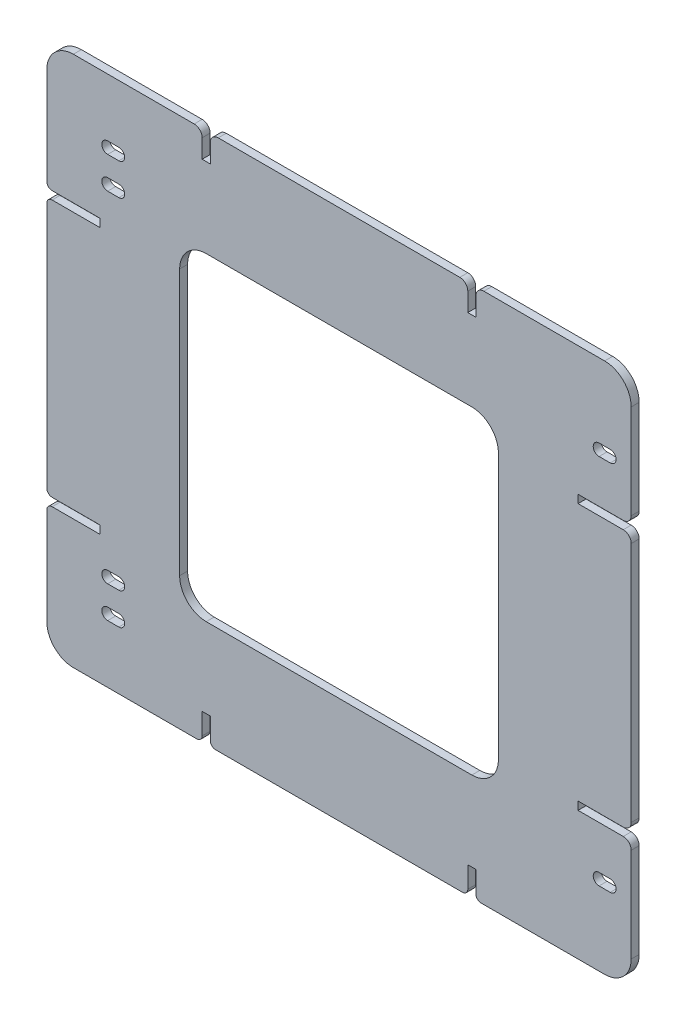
ISO-10303-21;
HEADER;
FILE_DESCRIPTION(('STEP AP214'),'2;1');
FILE_NAME('part.step','',(''),(''),'','','');
FILE_SCHEMA(('AUTOMOTIVE_DESIGN { 1 0 10303 214 1 1 1 1 }'));
ENDSEC;
DATA;
#1=APPLICATION_CONTEXT('core data for automotive mechanical design processes');
#2=APPLICATION_PROTOCOL_DEFINITION('international standard','automotive_design',2000,#1);
#3=PRODUCT_CONTEXT('',#1,'mechanical');
#4=PRODUCT('Part','Part','',(#3));
#5=PRODUCT_RELATED_PRODUCT_CATEGORY('part','',(#4));
#6=PRODUCT_DEFINITION_FORMATION('','',#4);
#7=PRODUCT_DEFINITION_CONTEXT('part definition',#1,'design');
#8=PRODUCT_DEFINITION('design','',#6,#7);
#9=PRODUCT_DEFINITION_SHAPE('','',#8);
#10=(LENGTH_UNIT() NAMED_UNIT(*) SI_UNIT(.MILLI.,.METRE.));
#11=(NAMED_UNIT(*) PLANE_ANGLE_UNIT() SI_UNIT($,.RADIAN.));
#12=(NAMED_UNIT(*) SI_UNIT($,.STERADIAN.) SOLID_ANGLE_UNIT());
#13=UNCERTAINTY_MEASURE_WITH_UNIT(LENGTH_MEASURE(1.E-05),#10,'distance_accuracy_value','');
#14=(GEOMETRIC_REPRESENTATION_CONTEXT(3) GLOBAL_UNCERTAINTY_ASSIGNED_CONTEXT((#13)) GLOBAL_UNIT_ASSIGNED_CONTEXT((#10,
#11,#12)) REPRESENTATION_CONTEXT('',''));
#15=CARTESIAN_POINT('',(0.,0.,0.));
#16=DIRECTION('',(0.,0.,1.));
#17=DIRECTION('',(1.,0.,0.));
#18=AXIS2_PLACEMENT_3D('',#15,#16,#17);
#19=CARTESIAN_POINT('',(-110.,100.,3.));
#20=DIRECTION('',(1.,0.,0.));
#21=DIRECTION('',(0.,1.,0.));
#22=AXIS2_PLACEMENT_3D('',#19,#20,#21);
#23=PLANE('',#22);
#24=DIRECTION('',(0.,-1.,0.));
#25=VECTOR('',#24,1.);
#26=CARTESIAN_POINT('',(-110.,100.,3.));
#27=LINE('',#26,#25);
#28=CARTESIAN_POINT('',(-110.,-53.525,3.));
#29=VERTEX_POINT('',#28);
#30=CARTESIAN_POINT('',(-110.,-90.,3.));
#31=VERTEX_POINT('',#30);
#32=EDGE_CURVE('E900',#29,#31,#27,.T.);
#33=ORIENTED_EDGE('',*,*,#32,.F.);
#34=DIRECTION('',(0.,0.,-1.));
#35=VECTOR('',#34,1.);
#36=CARTESIAN_POINT('',(-110.,-53.525,3.));
#37=LINE('',#36,#35);
#38=CARTESIAN_POINT('',(-110.,-53.525,0.));
#39=VERTEX_POINT('',#38);
#40=EDGE_CURVE('E1026',#29,#39,#37,.T.);
#41=ORIENTED_EDGE('',*,*,#40,.T.);
#42=DIRECTION('',(0.,-1.,0.));
#43=VECTOR('',#42,1.);
#44=CARTESIAN_POINT('',(-110.,100.,0.));
#45=LINE('',#44,#43);
#46=CARTESIAN_POINT('',(-110.,-90.,0.));
#47=VERTEX_POINT('',#46);
#48=EDGE_CURVE('E920',#39,#47,#45,.T.);
#49=ORIENTED_EDGE('',*,*,#48,.T.);
#50=DIRECTION('',(0.,0.,-1.));
#51=VECTOR('',#50,1.);
#52=CARTESIAN_POINT('',(-110.,-90.,3.));
#53=LINE('',#52,#51);
#54=EDGE_CURVE('E962',#47,#31,#53,.F.);
#55=ORIENTED_EDGE('',*,*,#54,.T.);
#56=EDGE_LOOP('',(#33,#41,#49,#55));
#57=FACE_BOUND('',#56,.T.);
#58=ADVANCED_FACE('F36',(#57),#23,.F.);
#59=CARTESIAN_POINT('',(110.,100.,3.));
#60=DIRECTION('',(-1.,0.,0.));
#61=DIRECTION('',(0.,-1.,0.));
#62=AXIS2_PLACEMENT_3D('',#59,#60,#61);
#63=PLANE('',#62);
#64=DIRECTION('',(0.,1.,0.));
#65=VECTOR('',#64,1.);
#66=CARTESIAN_POINT('',(110.,100.,3.));
#67=LINE('',#66,#65);
#68=CARTESIAN_POINT('',(110.,-45.475,3.));
#69=VERTEX_POINT('',#68);
#70=CARTESIAN_POINT('',(110.,45.475,3.));
#71=VERTEX_POINT('',#70);
#72=EDGE_CURVE('E895',#69,#71,#67,.T.);
#73=ORIENTED_EDGE('',*,*,#72,.F.);
#74=DIRECTION('',(0.,0.,-1.));
#75=VECTOR('',#74,1.);
#76=CARTESIAN_POINT('',(110.,-45.475,3.));
#77=LINE('',#76,#75);
#78=CARTESIAN_POINT('',(110.,-45.475,0.));
#79=VERTEX_POINT('',#78);
#80=EDGE_CURVE('E1138',#69,#79,#77,.T.);
#81=ORIENTED_EDGE('',*,*,#80,.T.);
#82=DIRECTION('',(0.,1.,0.));
#83=VECTOR('',#82,1.);
#84=CARTESIAN_POINT('',(110.,100.,0.));
#85=LINE('',#84,#83);
#86=CARTESIAN_POINT('',(110.,45.475,0.));
#87=VERTEX_POINT('',#86);
#88=EDGE_CURVE('E916',#79,#87,#85,.T.);
#89=ORIENTED_EDGE('',*,*,#88,.T.);
#90=DIRECTION('',(0.,0.,1.));
#91=VECTOR('',#90,1.);
#92=CARTESIAN_POINT('',(110.,45.475,3.));
#93=LINE('',#92,#91);
#94=EDGE_CURVE('E1135',#87,#71,#93,.T.);
#95=ORIENTED_EDGE('',*,*,#94,.T.);
#96=EDGE_LOOP('',(#73,#81,#89,#95));
#97=FACE_BOUND('',#96,.T.);
#98=ADVANCED_FACE('F1265',(#97),#63,.F.);
#99=CARTESIAN_POINT('',(110.,-90.,0.));
#100=VERTEX_POINT('',#99);
#101=CARTESIAN_POINT('',(110.,-54.525,0.));
#102=VERTEX_POINT('',#101);
#103=EDGE_CURVE('E912',#100,#102,#85,.T.);
#104=ORIENTED_EDGE('',*,*,#103,.T.);
#105=DIRECTION('',(0.,0.,1.));
#106=VECTOR('',#105,1.);
#107=CARTESIAN_POINT('',(110.,-54.525,3.));
#108=LINE('',#107,#106);
#109=CARTESIAN_POINT('',(110.,-54.525,3.));
#110=VERTEX_POINT('',#109);
#111=EDGE_CURVE('E1098',#102,#110,#108,.T.);
#112=ORIENTED_EDGE('',*,*,#111,.T.);
#113=CARTESIAN_POINT('',(110.,-90.,3.));
#114=VERTEX_POINT('',#113);
#115=EDGE_CURVE('E891',#114,#110,#67,.T.);
#116=ORIENTED_EDGE('',*,*,#115,.F.);
#117=DIRECTION('',(0.,0.,-1.));
#118=VECTOR('',#117,1.);
#119=CARTESIAN_POINT('',(110.,-90.,3.));
#120=LINE('',#119,#118);
#121=EDGE_CURVE('E933',#114,#100,#120,.T.);
#122=ORIENTED_EDGE('',*,*,#121,.T.);
#123=EDGE_LOOP('',(#104,#112,#116,#122));
#124=FACE_BOUND('',#123,.T.);
#125=ADVANCED_FACE('F1273',(#124),#63,.F.);
#126=CARTESIAN_POINT('',(-110.,100.,3.));
#127=DIRECTION('',(0.,-1.,0.));
#128=DIRECTION('',(0.,0.,-1.));
#129=AXIS2_PLACEMENT_3D('',#126,#127,#128);
#130=PLANE('',#129);
#131=DIRECTION('',(-1.,0.,0.));
#132=VECTOR('',#131,1.);
#133=CARTESIAN_POINT('',(-110.,100.,3.));
#134=LINE('',#133,#132);
#135=CARTESIAN_POINT('',(-54.525,100.,3.));
#136=VERTEX_POINT('',#135);
#137=CARTESIAN_POINT('',(-100.,100.,3.));
#138=VERTEX_POINT('',#137);
#139=EDGE_CURVE('E894',#136,#138,#134,.T.);
#140=ORIENTED_EDGE('',*,*,#139,.F.);
#141=DIRECTION('',(0.,0.,-1.));
#142=VECTOR('',#141,1.);
#143=CARTESIAN_POINT('',(-54.525,100.,3.));
#144=LINE('',#143,#142);
#145=CARTESIAN_POINT('',(-54.525,100.,0.));
#146=VERTEX_POINT('',#145);
#147=EDGE_CURVE('E1165',#136,#146,#144,.T.);
#148=ORIENTED_EDGE('',*,*,#147,.T.);
#149=DIRECTION('',(-1.,0.,0.));
#150=VECTOR('',#149,1.);
#151=CARTESIAN_POINT('',(-110.,100.,0.));
#152=LINE('',#151,#150);
#153=CARTESIAN_POINT('',(-100.,100.,0.));
#154=VERTEX_POINT('',#153);
#155=EDGE_CURVE('E915',#146,#154,#152,.T.);
#156=ORIENTED_EDGE('',*,*,#155,.T.);
#157=DIRECTION('',(0.,0.,-1.));
#158=VECTOR('',#157,1.);
#159=CARTESIAN_POINT('',(-100.,100.,3.));
#160=LINE('',#159,#158);
#161=EDGE_CURVE('E971',#154,#138,#160,.F.);
#162=ORIENTED_EDGE('',*,*,#161,.T.);
#163=EDGE_LOOP('',(#140,#148,#156,#162));
#164=FACE_BOUND('',#163,.T.);
#165=ADVANCED_FACE('F1294',(#164),#130,.F.);
#166=CARTESIAN_POINT('',(45.475,100.,3.));
#167=VERTEX_POINT('',#166);
#168=CARTESIAN_POINT('',(-45.475,100.,3.));
#169=VERTEX_POINT('',#168);
#170=EDGE_CURVE('E901',#167,#169,#134,.T.);
#171=ORIENTED_EDGE('',*,*,#170,.F.);
#172=DIRECTION('',(0.,0.,-1.));
#173=VECTOR('',#172,1.);
#174=CARTESIAN_POINT('',(45.475,100.,3.));
#175=LINE('',#174,#173);
#176=CARTESIAN_POINT('',(45.475,100.,0.));
#177=VERTEX_POINT('',#176);
#178=EDGE_CURVE('E1153',#167,#177,#175,.T.);
#179=ORIENTED_EDGE('',*,*,#178,.T.);
#180=CARTESIAN_POINT('',(-45.475,100.,0.));
#181=VERTEX_POINT('',#180);
#182=EDGE_CURVE('E921',#177,#181,#152,.T.);
#183=ORIENTED_EDGE('',*,*,#182,.T.);
#184=DIRECTION('',(0.,0.,1.));
#185=VECTOR('',#184,1.);
#186=CARTESIAN_POINT('',(-45.475,100.,3.));
#187=LINE('',#186,#185);
#188=EDGE_CURVE('E1150',#181,#169,#187,.T.);
#189=ORIENTED_EDGE('',*,*,#188,.T.);
#190=EDGE_LOOP('',(#171,#179,#183,#189));
#191=FACE_BOUND('',#190,.T.);
#192=ADVANCED_FACE('F1295',(#191),#130,.F.);
#193=CARTESIAN_POINT('',(-110.,-100.,3.));
#194=DIRECTION('',(0.,1.,0.));
#195=DIRECTION('',(0.,0.,1.));
#196=AXIS2_PLACEMENT_3D('',#193,#194,#195);
#197=PLANE('',#196);
#198=DIRECTION('',(1.,0.,0.));
#199=VECTOR('',#198,1.);
#200=CARTESIAN_POINT('',(-110.,-100.,3.));
#201=LINE('',#200,#199);
#202=CARTESIAN_POINT('',(53.525,-100.,3.));
#203=VERTEX_POINT('',#202);
#204=CARTESIAN_POINT('',(100.,-100.,3.));
#205=VERTEX_POINT('',#204);
#206=EDGE_CURVE('E905',#203,#205,#201,.T.);
#207=ORIENTED_EDGE('',*,*,#206,.F.);
#208=DIRECTION('',(0.,0.,-1.));
#209=VECTOR('',#208,1.);
#210=CARTESIAN_POINT('',(53.525,-100.,3.));
#211=LINE('',#210,#209);
#212=CARTESIAN_POINT('',(53.525,-100.,0.));
#213=VERTEX_POINT('',#212);
#214=EDGE_CURVE('E1084',#203,#213,#211,.T.);
#215=ORIENTED_EDGE('',*,*,#214,.T.);
#216=DIRECTION('',(1.,0.,0.));
#217=VECTOR('',#216,1.);
#218=CARTESIAN_POINT('',(-110.,-100.,0.));
#219=LINE('',#218,#217);
#220=CARTESIAN_POINT('',(100.,-100.,0.));
#221=VERTEX_POINT('',#220);
#222=EDGE_CURVE('E925',#213,#221,#219,.T.);
#223=ORIENTED_EDGE('',*,*,#222,.T.);
#224=DIRECTION('',(0.,0.,-1.));
#225=VECTOR('',#224,1.);
#226=CARTESIAN_POINT('',(100.,-100.,3.));
#227=LINE('',#226,#225);
#228=EDGE_CURVE('E951',#221,#205,#227,.F.);
#229=ORIENTED_EDGE('',*,*,#228,.T.);
#230=EDGE_LOOP('',(#207,#215,#223,#229));
#231=FACE_BOUND('',#230,.T.);
#232=ADVANCED_FACE('F1292',(#231),#197,.F.);
#233=CARTESIAN_POINT('',(-46.475,-100.,3.));
#234=VERTEX_POINT('',#233);
#235=CARTESIAN_POINT('',(46.475,-100.,3.));
#236=VERTEX_POINT('',#235);
#237=EDGE_CURVE('E911',#234,#236,#201,.T.);
#238=ORIENTED_EDGE('',*,*,#237,.F.);
#239=DIRECTION('',(0.,0.,-1.));
#240=VECTOR('',#239,1.);
#241=CARTESIAN_POINT('',(-46.475,-100.,3.));
#242=LINE('',#241,#240);
#243=CARTESIAN_POINT('',(-46.475,-100.,0.));
#244=VERTEX_POINT('',#243);
#245=EDGE_CURVE('E1074',#234,#244,#242,.T.);
#246=ORIENTED_EDGE('',*,*,#245,.T.);
#247=CARTESIAN_POINT('',(46.475,-100.,0.));
#248=VERTEX_POINT('',#247);
#249=EDGE_CURVE('E930',#244,#248,#219,.T.);
#250=ORIENTED_EDGE('',*,*,#249,.T.);
#251=DIRECTION('',(0.,0.,1.));
#252=VECTOR('',#251,1.);
#253=CARTESIAN_POINT('',(46.475,-100.,3.));
#254=LINE('',#253,#252);
#255=EDGE_CURVE('E1071',#248,#236,#254,.T.);
#256=ORIENTED_EDGE('',*,*,#255,.T.);
#257=EDGE_LOOP('',(#238,#246,#250,#256));
#258=FACE_BOUND('',#257,.T.);
#259=ADVANCED_FACE('F1281',(#258),#197,.F.);
#260=CARTESIAN_POINT('',(-110.,46.475,0.));
#261=VERTEX_POINT('',#260);
#262=CARTESIAN_POINT('',(-110.,-46.475,0.));
#263=VERTEX_POINT('',#262);
#264=EDGE_CURVE('E926',#261,#263,#45,.T.);
#265=ORIENTED_EDGE('',*,*,#264,.T.);
#266=DIRECTION('',(0.,0.,1.));
#267=VECTOR('',#266,1.);
#268=CARTESIAN_POINT('',(-110.,-46.475,3.));
#269=LINE('',#268,#267);
#270=CARTESIAN_POINT('',(-110.,-46.475,3.));
#271=VERTEX_POINT('',#270);
#272=EDGE_CURVE('E1066',#263,#271,#269,.T.);
#273=ORIENTED_EDGE('',*,*,#272,.T.);
#274=CARTESIAN_POINT('',(-110.,46.475,3.));
#275=VERTEX_POINT('',#274);
#276=EDGE_CURVE('E906',#275,#271,#27,.T.);
#277=ORIENTED_EDGE('',*,*,#276,.F.);
#278=DIRECTION('',(0.,0.,-1.));
#279=VECTOR('',#278,1.);
#280=CARTESIAN_POINT('',(-110.,46.475,3.));
#281=LINE('',#280,#279);
#282=EDGE_CURVE('E1063',#275,#261,#281,.T.);
#283=ORIENTED_EDGE('',*,*,#282,.T.);
#284=EDGE_LOOP('',(#265,#273,#277,#283));
#285=FACE_BOUND('',#284,.T.);
#286=ADVANCED_FACE('F1268',(#285),#23,.F.);
#287=CARTESIAN_POINT('',(110.,54.525,3.));
#288=VERTEX_POINT('',#287);
#289=CARTESIAN_POINT('',(110.,90.,3.));
#290=VERTEX_POINT('',#289);
#291=EDGE_CURVE('E896',#288,#290,#67,.T.);
#292=ORIENTED_EDGE('',*,*,#291,.F.);
#293=DIRECTION('',(0.,0.,-1.));
#294=VECTOR('',#293,1.);
#295=CARTESIAN_POINT('',(110.,54.525,3.));
#296=LINE('',#295,#294);
#297=CARTESIAN_POINT('',(110.,54.525,0.));
#298=VERTEX_POINT('',#297);
#299=EDGE_CURVE('E1145',#288,#298,#296,.T.);
#300=ORIENTED_EDGE('',*,*,#299,.T.);
#301=CARTESIAN_POINT('',(110.,90.,0.));
#302=VERTEX_POINT('',#301);
#303=EDGE_CURVE('E880',#298,#302,#85,.T.);
#304=ORIENTED_EDGE('',*,*,#303,.T.);
#305=DIRECTION('',(0.,0.,-1.));
#306=VECTOR('',#305,1.);
#307=CARTESIAN_POINT('',(110.,90.,3.));
#308=LINE('',#307,#306);
#309=EDGE_CURVE('E910',#302,#290,#308,.F.);
#310=ORIENTED_EDGE('',*,*,#309,.T.);
#311=EDGE_LOOP('',(#292,#300,#304,#310));
#312=FACE_BOUND('',#311,.T.);
#313=ADVANCED_FACE('F1276',(#312),#63,.F.);
#314=CARTESIAN_POINT('',(100.,100.,0.));
#315=VERTEX_POINT('',#314);
#316=CARTESIAN_POINT('',(54.525,100.,0.));
#317=VERTEX_POINT('',#316);
#318=EDGE_CURVE('E917',#315,#317,#152,.T.);
#319=ORIENTED_EDGE('',*,*,#318,.T.);
#320=DIRECTION('',(0.,0.,1.));
#321=VECTOR('',#320,1.);
#322=CARTESIAN_POINT('',(54.525,100.,3.));
#323=LINE('',#322,#321);
#324=CARTESIAN_POINT('',(54.525,100.,3.));
#325=VERTEX_POINT('',#324);
#326=EDGE_CURVE('E1158',#317,#325,#323,.T.);
#327=ORIENTED_EDGE('',*,*,#326,.T.);
#328=CARTESIAN_POINT('',(100.,100.,3.));
#329=VERTEX_POINT('',#328);
#330=EDGE_CURVE('E897',#329,#325,#134,.T.);
#331=ORIENTED_EDGE('',*,*,#330,.F.);
#332=DIRECTION('',(0.,0.,-1.));
#333=VECTOR('',#332,1.);
#334=CARTESIAN_POINT('',(100.,100.,3.));
#335=LINE('',#334,#333);
#336=EDGE_CURVE('E968',#329,#315,#335,.T.);
#337=ORIENTED_EDGE('',*,*,#336,.T.);
#338=EDGE_LOOP('',(#319,#327,#331,#337));
#339=FACE_BOUND('',#338,.T.);
#340=ADVANCED_FACE('F1285',(#339),#130,.F.);
#341=CARTESIAN_POINT('',(-110.,90.,0.));
#342=VERTEX_POINT('',#341);
#343=CARTESIAN_POINT('',(-110.,53.525,0.));
#344=VERTEX_POINT('',#343);
#345=EDGE_CURVE('E922',#342,#344,#45,.T.);
#346=ORIENTED_EDGE('',*,*,#345,.T.);
#347=DIRECTION('',(0.,0.,1.));
#348=VECTOR('',#347,1.);
#349=CARTESIAN_POINT('',(-110.,53.525,3.));
#350=LINE('',#349,#348);
#351=CARTESIAN_POINT('',(-110.,53.525,3.));
#352=VERTEX_POINT('',#351);
#353=EDGE_CURVE('E1093',#344,#352,#350,.T.);
#354=ORIENTED_EDGE('',*,*,#353,.T.);
#355=CARTESIAN_POINT('',(-110.,90.,3.));
#356=VERTEX_POINT('',#355);
#357=EDGE_CURVE('E902',#356,#352,#27,.T.);
#358=ORIENTED_EDGE('',*,*,#357,.F.);
#359=DIRECTION('',(0.,0.,-1.));
#360=VECTOR('',#359,1.);
#361=CARTESIAN_POINT('',(-110.,90.,3.));
#362=LINE('',#361,#360);
#363=EDGE_CURVE('E965',#356,#342,#362,.T.);
#364=ORIENTED_EDGE('',*,*,#363,.T.);
#365=EDGE_LOOP('',(#346,#354,#358,#364));
#366=FACE_BOUND('',#365,.T.);
#367=ADVANCED_FACE('F1269',(#366),#23,.F.);
#368=CARTESIAN_POINT('',(-100.,-100.,0.));
#369=VERTEX_POINT('',#368);
#370=CARTESIAN_POINT('',(-53.525,-100.,0.));
#371=VERTEX_POINT('',#370);
#372=EDGE_CURVE('E927',#369,#371,#219,.T.);
#373=ORIENTED_EDGE('',*,*,#372,.T.);
#374=DIRECTION('',(0.,0.,1.));
#375=VECTOR('',#374,1.);
#376=CARTESIAN_POINT('',(-53.525,-100.,3.));
#377=LINE('',#376,#375);
#378=CARTESIAN_POINT('',(-53.525,-100.,3.));
#379=VERTEX_POINT('',#378);
#380=EDGE_CURVE('E1079',#371,#379,#377,.T.);
#381=ORIENTED_EDGE('',*,*,#380,.T.);
#382=CARTESIAN_POINT('',(-100.,-100.,3.));
#383=VERTEX_POINT('',#382);
#384=EDGE_CURVE('E907',#383,#379,#201,.T.);
#385=ORIENTED_EDGE('',*,*,#384,.F.);
#386=DIRECTION('',(0.,0.,-1.));
#387=VECTOR('',#386,1.);
#388=CARTESIAN_POINT('',(-100.,-100.,3.));
#389=LINE('',#388,#387);
#390=EDGE_CURVE('E948',#383,#369,#389,.T.);
#391=ORIENTED_EDGE('',*,*,#390,.T.);
#392=EDGE_LOOP('',(#373,#381,#385,#391));
#393=FACE_BOUND('',#392,.T.);
#394=ADVANCED_FACE('F1284',(#393),#197,.F.);
#395=CARTESIAN_POINT('',(0.,0.,3.));
#396=DIRECTION('',(0.,0.,1.));
#397=DIRECTION('',(1.,0.,0.));
#398=AXIS2_PLACEMENT_3D('',#395,#396,#397);
#399=PLANE('',#398);
#400=CARTESIAN_POINT('',(97.9000000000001,-70.0000000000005,3.));
#401=DIRECTION('',(0.,0.,1.));
#402=DIRECTION('',(1.,0.,0.));
#403=AXIS2_PLACEMENT_3D('',#400,#401,#402);
#404=CIRCLE('',#403,2.19999999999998);
#405=CARTESIAN_POINT('',(97.9000000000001,-67.8000000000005,3.));
#406=VERTEX_POINT('',#405);
#407=CARTESIAN_POINT('',(97.9000000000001,-72.2000000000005,3.));
#408=VERTEX_POINT('',#407);
#409=EDGE_CURVE('E51',#406,#408,#404,.T.);
#410=ORIENTED_EDGE('',*,*,#409,.F.);
#411=DIRECTION('',(-1.,0.,0.));
#412=VECTOR('',#411,1.);
#413=CARTESIAN_POINT('',(97.9000000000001,-67.8000000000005,3.));
#414=LINE('',#413,#412);
#415=CARTESIAN_POINT('',(102.1,-67.8000000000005,3.));
#416=VERTEX_POINT('',#415);
#417=EDGE_CURVE('E645',#416,#406,#414,.T.);
#418=ORIENTED_EDGE('',*,*,#417,.F.);
#419=CARTESIAN_POINT('',(102.1,-70.0000000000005,3.));
#420=DIRECTION('',(0.,0.,1.));
#421=DIRECTION('',(1.,0.,0.));
#422=AXIS2_PLACEMENT_3D('',#419,#420,#421);
#423=CIRCLE('',#422,2.19999999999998);
#424=CARTESIAN_POINT('',(102.1,-72.2000000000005,3.));
#425=VERTEX_POINT('',#424);
#426=EDGE_CURVE('E642',#425,#416,#423,.T.);
#427=ORIENTED_EDGE('',*,*,#426,.F.);
#428=DIRECTION('',(1.,0.,0.));
#429=VECTOR('',#428,1.);
#430=CARTESIAN_POINT('',(97.9000000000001,-72.2000000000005,3.));
#431=LINE('',#430,#429);
#432=EDGE_CURVE('E639',#408,#425,#431,.T.);
#433=ORIENTED_EDGE('',*,*,#432,.F.);
#434=EDGE_LOOP('',(#410,#418,#427,#433));
#435=FACE_BOUND('',#434,.T.);
#436=CARTESIAN_POINT('',(97.9000000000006,69.9999999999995,3.));
#437=DIRECTION('',(0.,0.,1.));
#438=DIRECTION('',(1.,0.,0.));
#439=AXIS2_PLACEMENT_3D('',#436,#437,#438);
#440=CIRCLE('',#439,2.20000000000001);
#441=CARTESIAN_POINT('',(97.9000000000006,72.1999999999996,3.));
#442=VERTEX_POINT('',#441);
#443=CARTESIAN_POINT('',(97.9000000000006,67.7999999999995,3.));
#444=VERTEX_POINT('',#443);
#445=EDGE_CURVE('E59',#442,#444,#440,.T.);
#446=ORIENTED_EDGE('',*,*,#445,.F.);
#447=DIRECTION('',(-1.,0.,0.));
#448=VECTOR('',#447,1.);
#449=CARTESIAN_POINT('',(97.9000000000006,72.1999999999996,3.));
#450=LINE('',#449,#448);
#451=CARTESIAN_POINT('',(102.100000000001,72.1999999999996,3.));
#452=VERTEX_POINT('',#451);
#453=EDGE_CURVE('E627',#452,#442,#450,.T.);
#454=ORIENTED_EDGE('',*,*,#453,.F.);
#455=CARTESIAN_POINT('',(102.100000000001,69.9999999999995,3.));
#456=DIRECTION('',(0.,0.,1.));
#457=DIRECTION('',(1.,0.,0.));
#458=AXIS2_PLACEMENT_3D('',#455,#456,#457);
#459=CIRCLE('',#458,2.20000000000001);
#460=CARTESIAN_POINT('',(102.100000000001,67.7999999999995,3.));
#461=VERTEX_POINT('',#460);
#462=EDGE_CURVE('E624',#461,#452,#459,.T.);
#463=ORIENTED_EDGE('',*,*,#462,.F.);
#464=DIRECTION('',(1.,0.,0.));
#465=VECTOR('',#464,1.);
#466=CARTESIAN_POINT('',(97.9000000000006,67.7999999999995,3.));
#467=LINE('',#466,#465);
#468=EDGE_CURVE('E620',#444,#461,#467,.T.);
#469=ORIENTED_EDGE('',*,*,#468,.F.);
#470=EDGE_LOOP('',(#446,#454,#463,#469));
#471=FACE_BOUND('',#470,.T.);
#472=CARTESIAN_POINT('',(-87.1000000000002,-75.9999999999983,3.));
#473=DIRECTION('',(0.,0.,1.));
#474=DIRECTION('',(1.,0.,0.));
#475=AXIS2_PLACEMENT_3D('',#472,#473,#474);
#476=CIRCLE('',#475,2.20000000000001);
#477=CARTESIAN_POINT('',(-87.1000000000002,-73.7999999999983,3.));
#478=VERTEX_POINT('',#477);
#479=CARTESIAN_POINT('',(-87.1000000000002,-78.1999999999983,3.));
#480=VERTEX_POINT('',#479);
#481=EDGE_CURVE('E604',#478,#480,#476,.T.);
#482=ORIENTED_EDGE('',*,*,#481,.F.);
#483=DIRECTION('',(-1.,0.,0.));
#484=VECTOR('',#483,1.);
#485=CARTESIAN_POINT('',(-87.1000000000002,-73.7999999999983,3.));
#486=LINE('',#485,#484);
#487=CARTESIAN_POINT('',(-82.9000000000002,-73.7999999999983,3.));
#488=VERTEX_POINT('',#487);
#489=EDGE_CURVE('E609',#488,#478,#486,.T.);
#490=ORIENTED_EDGE('',*,*,#489,.F.);
#491=CARTESIAN_POINT('',(-82.9000000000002,-75.9999999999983,3.));
#492=DIRECTION('',(0.,0.,1.));
#493=DIRECTION('',(1.,0.,0.));
#494=AXIS2_PLACEMENT_3D('',#491,#492,#493);
#495=CIRCLE('',#494,2.20000000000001);
#496=CARTESIAN_POINT('',(-82.9000000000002,-78.1999999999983,3.));
#497=VERTEX_POINT('',#496);
#498=EDGE_CURVE('E588',#497,#488,#495,.T.);
#499=ORIENTED_EDGE('',*,*,#498,.F.);
#500=DIRECTION('',(1.,0.,0.));
#501=VECTOR('',#500,1.);
#502=CARTESIAN_POINT('',(-87.1000000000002,-78.1999999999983,3.));
#503=LINE('',#502,#501);
#504=EDGE_CURVE('E599',#480,#497,#503,.T.);
#505=ORIENTED_EDGE('',*,*,#504,.F.);
#506=EDGE_LOOP('',(#482,#490,#499,#505));
#507=FACE_BOUND('',#506,.T.);
#508=CARTESIAN_POINT('',(-87.1000000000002,-63.9999999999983,3.));
#509=DIRECTION('',(0.,0.,1.));
#510=DIRECTION('',(1.,0.,0.));
#511=AXIS2_PLACEMENT_3D('',#508,#509,#510);
#512=CIRCLE('',#511,2.19999999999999);
#513=CARTESIAN_POINT('',(-87.1000000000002,-61.7999999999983,3.));
#514=VERTEX_POINT('',#513);
#515=CARTESIAN_POINT('',(-87.1000000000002,-66.1999999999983,3.));
#516=VERTEX_POINT('',#515);
#517=EDGE_CURVE('E616',#514,#516,#512,.T.);
#518=ORIENTED_EDGE('',*,*,#517,.F.);
#519=DIRECTION('',(-1.,0.,0.));
#520=VECTOR('',#519,1.);
#521=CARTESIAN_POINT('',(-87.1000000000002,-61.7999999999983,3.));
#522=LINE('',#521,#520);
#523=CARTESIAN_POINT('',(-82.9000000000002,-61.7999999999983,3.));
#524=VERTEX_POINT('',#523);
#525=EDGE_CURVE('E684',#524,#514,#522,.T.);
#526=ORIENTED_EDGE('',*,*,#525,.F.);
#527=CARTESIAN_POINT('',(-82.9000000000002,-63.9999999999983,3.));
#528=DIRECTION('',(0.,0.,1.));
#529=DIRECTION('',(1.,0.,0.));
#530=AXIS2_PLACEMENT_3D('',#527,#528,#529);
#531=CIRCLE('',#530,2.19999999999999);
#532=CARTESIAN_POINT('',(-82.9000000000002,-66.1999999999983,3.));
#533=VERTEX_POINT('',#532);
#534=EDGE_CURVE('E681',#533,#524,#531,.T.);
#535=ORIENTED_EDGE('',*,*,#534,.F.);
#536=DIRECTION('',(1.,0.,0.));
#537=VECTOR('',#536,1.);
#538=CARTESIAN_POINT('',(-87.1000000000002,-66.1999999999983,3.));
#539=LINE('',#538,#537);
#540=EDGE_CURVE('E678',#516,#533,#539,.T.);
#541=ORIENTED_EDGE('',*,*,#540,.F.);
#542=EDGE_LOOP('',(#518,#526,#535,#541));
#543=FACE_BOUND('',#542,.T.);
#544=CARTESIAN_POINT('',(-87.1000000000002,64.0000000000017,3.));
#545=DIRECTION('',(0.,0.,1.));
#546=DIRECTION('',(1.,0.,0.));
#547=AXIS2_PLACEMENT_3D('',#544,#545,#546);
#548=CIRCLE('',#547,2.19999999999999);
#549=CARTESIAN_POINT('',(-87.1000000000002,66.2000000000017,3.));
#550=VERTEX_POINT('',#549);
#551=CARTESIAN_POINT('',(-87.1000000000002,61.8000000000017,3.));
#552=VERTEX_POINT('',#551);
#553=EDGE_CURVE('E655',#550,#552,#548,.T.);
#554=ORIENTED_EDGE('',*,*,#553,.F.);
#555=DIRECTION('',(-1.,0.,0.));
#556=VECTOR('',#555,1.);
#557=CARTESIAN_POINT('',(-87.1000000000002,66.2000000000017,3.));
#558=LINE('',#557,#556);
#559=CARTESIAN_POINT('',(-82.9000000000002,66.2000000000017,3.));
#560=VERTEX_POINT('',#559);
#561=EDGE_CURVE('E664',#560,#550,#558,.T.);
#562=ORIENTED_EDGE('',*,*,#561,.F.);
#563=CARTESIAN_POINT('',(-82.9000000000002,64.0000000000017,3.));
#564=DIRECTION('',(0.,0.,1.));
#565=DIRECTION('',(1.,0.,0.));
#566=AXIS2_PLACEMENT_3D('',#563,#564,#565);
#567=CIRCLE('',#566,2.19999999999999);
#568=CARTESIAN_POINT('',(-82.9000000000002,61.8000000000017,3.));
#569=VERTEX_POINT('',#568);
#570=EDGE_CURVE('E661',#569,#560,#567,.T.);
#571=ORIENTED_EDGE('',*,*,#570,.F.);
#572=DIRECTION('',(1.,0.,0.));
#573=VECTOR('',#572,1.);
#574=CARTESIAN_POINT('',(-87.1000000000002,61.8000000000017,3.));
#575=LINE('',#574,#573);
#576=EDGE_CURVE('E657',#552,#569,#575,.T.);
#577=ORIENTED_EDGE('',*,*,#576,.F.);
#578=EDGE_LOOP('',(#554,#562,#571,#577));
#579=FACE_BOUND('',#578,.T.);
#580=CARTESIAN_POINT('',(-87.0999999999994,75.9999999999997,3.));
#581=DIRECTION('',(0.,0.,1.));
#582=DIRECTION('',(1.,0.,0.));
#583=AXIS2_PLACEMENT_3D('',#580,#581,#582);
#584=CIRCLE('',#583,2.19999999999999);
#585=CARTESIAN_POINT('',(-87.0999999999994,78.1999999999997,3.));
#586=VERTEX_POINT('',#585);
#587=CARTESIAN_POINT('',(-87.0999999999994,73.7999999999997,3.));
#588=VERTEX_POINT('',#587);
#589=EDGE_CURVE('E670',#586,#588,#584,.T.);
#590=ORIENTED_EDGE('',*,*,#589,.F.);
#591=DIRECTION('',(-1.,0.,0.));
#592=VECTOR('',#591,1.);
#593=CARTESIAN_POINT('',(-87.0999999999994,78.1999999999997,3.));
#594=LINE('',#593,#592);
#595=CARTESIAN_POINT('',(-82.8999999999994,78.1999999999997,3.));
#596=VERTEX_POINT('',#595);
#597=EDGE_CURVE('E702',#596,#586,#594,.T.);
#598=ORIENTED_EDGE('',*,*,#597,.F.);
#599=CARTESIAN_POINT('',(-82.8999999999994,75.9999999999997,3.));
#600=DIRECTION('',(0.,0.,1.));
#601=DIRECTION('',(1.,0.,0.));
#602=AXIS2_PLACEMENT_3D('',#599,#600,#601);
#603=CIRCLE('',#602,2.19999999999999);
#604=CARTESIAN_POINT('',(-82.8999999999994,73.7999999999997,3.));
#605=VERTEX_POINT('',#604);
#606=EDGE_CURVE('E699',#605,#596,#603,.T.);
#607=ORIENTED_EDGE('',*,*,#606,.F.);
#608=DIRECTION('',(1.,0.,0.));
#609=VECTOR('',#608,1.);
#610=CARTESIAN_POINT('',(-87.0999999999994,73.7999999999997,3.));
#611=LINE('',#610,#609);
#612=EDGE_CURVE('E696',#588,#605,#611,.T.);
#613=ORIENTED_EDGE('',*,*,#612,.F.);
#614=EDGE_LOOP('',(#590,#598,#607,#613));
#615=FACE_BOUND('',#614,.T.);
#616=ORIENTED_EDGE('',*,*,#115,.T.);
#617=CARTESIAN_POINT('',(107.,-54.525,3.));
#618=DIRECTION('',(0.,0.,1.));
#619=DIRECTION('',(1.,0.,0.));
#620=AXIS2_PLACEMENT_3D('',#617,#618,#619);
#621=CIRCLE('',#620,3.);
#622=CARTESIAN_POINT('',(107.,-51.525,3.));
#623=VERTEX_POINT('',#622);
#624=EDGE_CURVE('E1115',#110,#623,#621,.T.);
#625=ORIENTED_EDGE('',*,*,#624,.T.);
#626=DIRECTION('',(1.,0.,0.));
#627=VECTOR('',#626,1.);
#628=CARTESIAN_POINT('',(130.,-51.525,3.));
#629=LINE('',#628,#627);
#630=CARTESIAN_POINT('',(90.,-51.525,3.));
#631=VERTEX_POINT('',#630);
#632=EDGE_CURVE('E719',#631,#623,#629,.T.);
#633=ORIENTED_EDGE('',*,*,#632,.F.);
#634=DIRECTION('',(0.,-1.,0.));
#635=VECTOR('',#634,1.);
#636=CARTESIAN_POINT('',(90.,-48.475,3.));
#637=LINE('',#636,#635);
#638=CARTESIAN_POINT('',(90.,-48.475,3.));
#639=VERTEX_POINT('',#638);
#640=EDGE_CURVE('E725',#639,#631,#637,.T.);
#641=ORIENTED_EDGE('',*,*,#640,.F.);
#642=DIRECTION('',(-1.,0.,0.));
#643=VECTOR('',#642,1.);
#644=CARTESIAN_POINT('',(130.,-48.475,3.));
#645=LINE('',#644,#643);
#646=CARTESIAN_POINT('',(107.,-48.475,3.));
#647=VERTEX_POINT('',#646);
#648=EDGE_CURVE('E723',#647,#639,#645,.T.);
#649=ORIENTED_EDGE('',*,*,#648,.F.);
#650=CARTESIAN_POINT('',(107.,-45.475,3.));
#651=DIRECTION('',(0.,0.,1.));
#652=DIRECTION('',(1.,0.,0.));
#653=AXIS2_PLACEMENT_3D('',#650,#651,#652);
#654=CIRCLE('',#653,3.);
#655=EDGE_CURVE('E1113',#647,#69,#654,.T.);
#656=ORIENTED_EDGE('',*,*,#655,.T.);
#657=ORIENTED_EDGE('',*,*,#72,.T.);
#658=CARTESIAN_POINT('',(107.,45.475,3.));
#659=DIRECTION('',(0.,0.,1.));
#660=DIRECTION('',(1.,0.,0.));
#661=AXIS2_PLACEMENT_3D('',#658,#659,#660);
#662=CIRCLE('',#661,3.);
#663=CARTESIAN_POINT('',(107.,48.475,3.));
#664=VERTEX_POINT('',#663);
#665=EDGE_CURVE('E1111',#71,#664,#662,.T.);
#666=ORIENTED_EDGE('',*,*,#665,.T.);
#667=DIRECTION('',(1.,0.,0.));
#668=VECTOR('',#667,1.);
#669=CARTESIAN_POINT('',(130.,48.475,3.));
#670=LINE('',#669,#668);
#671=CARTESIAN_POINT('',(90.,48.475,3.));
#672=VERTEX_POINT('',#671);
#673=EDGE_CURVE('E740',#672,#664,#670,.T.);
#674=ORIENTED_EDGE('',*,*,#673,.F.);
#675=DIRECTION('',(0.,-1.,0.));
#676=VECTOR('',#675,1.);
#677=CARTESIAN_POINT('',(90.,51.525,3.));
#678=LINE('',#677,#676);
#679=CARTESIAN_POINT('',(90.,51.525,3.));
#680=VERTEX_POINT('',#679);
#681=EDGE_CURVE('E746',#680,#672,#678,.T.);
#682=ORIENTED_EDGE('',*,*,#681,.F.);
#683=DIRECTION('',(-1.,0.,0.));
#684=VECTOR('',#683,1.);
#685=CARTESIAN_POINT('',(130.,51.525,3.));
#686=LINE('',#685,#684);
#687=CARTESIAN_POINT('',(107.,51.525,3.));
#688=VERTEX_POINT('',#687);
#689=EDGE_CURVE('E744',#688,#680,#686,.T.);
#690=ORIENTED_EDGE('',*,*,#689,.F.);
#691=CARTESIAN_POINT('',(107.,54.525,3.));
#692=DIRECTION('',(0.,0.,1.));
#693=DIRECTION('',(1.,0.,0.));
#694=AXIS2_PLACEMENT_3D('',#691,#692,#693);
#695=CIRCLE('',#694,3.);
#696=EDGE_CURVE('E1109',#688,#288,#695,.T.);
#697=ORIENTED_EDGE('',*,*,#696,.T.);
#698=ORIENTED_EDGE('',*,*,#291,.T.);
#699=CARTESIAN_POINT('',(100.,90.,3.));
#700=DIRECTION('',(0.,0.,1.));
#701=DIRECTION('',(1.,0.,0.));
#702=AXIS2_PLACEMENT_3D('',#699,#700,#701);
#703=CIRCLE('',#702,10.);
#704=EDGE_CURVE('E956',#290,#329,#703,.T.);
#705=ORIENTED_EDGE('',*,*,#704,.T.);
#706=ORIENTED_EDGE('',*,*,#330,.T.);
#707=CARTESIAN_POINT('',(54.525,97.,3.));
#708=DIRECTION('',(0.,0.,1.));
#709=DIRECTION('',(1.,0.,0.));
#710=AXIS2_PLACEMENT_3D('',#707,#708,#709);
#711=CIRCLE('',#710,3.);
#712=CARTESIAN_POINT('',(51.525,97.,3.));
#713=VERTEX_POINT('',#712);
#714=EDGE_CURVE('E1105',#325,#713,#711,.T.);
#715=ORIENTED_EDGE('',*,*,#714,.T.);
#716=DIRECTION('',(0.,1.,0.));
#717=VECTOR('',#716,1.);
#718=CARTESIAN_POINT('',(51.525,110.,3.));
#719=LINE('',#718,#717);
#720=CARTESIAN_POINT('',(51.525,90.,3.));
#721=VERTEX_POINT('',#720);
#722=EDGE_CURVE('E759',#721,#713,#719,.T.);
#723=ORIENTED_EDGE('',*,*,#722,.F.);
#724=DIRECTION('',(1.,0.,0.));
#725=VECTOR('',#724,1.);
#726=CARTESIAN_POINT('',(48.475,90.,3.));
#727=LINE('',#726,#725);
#728=CARTESIAN_POINT('',(48.475,90.,3.));
#729=VERTEX_POINT('',#728);
#730=EDGE_CURVE('E765',#729,#721,#727,.T.);
#731=ORIENTED_EDGE('',*,*,#730,.F.);
#732=DIRECTION('',(0.,-1.,0.));
#733=VECTOR('',#732,1.);
#734=CARTESIAN_POINT('',(48.475,110.,3.));
#735=LINE('',#734,#733);
#736=CARTESIAN_POINT('',(48.475,97.,3.));
#737=VERTEX_POINT('',#736);
#738=EDGE_CURVE('E763',#737,#729,#735,.T.);
#739=ORIENTED_EDGE('',*,*,#738,.F.);
#740=CARTESIAN_POINT('',(45.475,97.,3.));
#741=DIRECTION('',(0.,0.,1.));
#742=DIRECTION('',(1.,0.,0.));
#743=AXIS2_PLACEMENT_3D('',#740,#741,#742);
#744=CIRCLE('',#743,3.);
#745=EDGE_CURVE('E1107',#737,#167,#744,.T.);
#746=ORIENTED_EDGE('',*,*,#745,.T.);
#747=ORIENTED_EDGE('',*,*,#170,.T.);
#748=CARTESIAN_POINT('',(-45.475,97.,3.));
#749=DIRECTION('',(0.,0.,1.));
#750=DIRECTION('',(1.,0.,0.));
#751=AXIS2_PLACEMENT_3D('',#748,#749,#750);
#752=CIRCLE('',#751,3.);
#753=CARTESIAN_POINT('',(-48.475,97.,3.));
#754=VERTEX_POINT('',#753);
#755=EDGE_CURVE('E1103',#169,#754,#752,.T.);
#756=ORIENTED_EDGE('',*,*,#755,.T.);
#757=DIRECTION('',(0.,1.,0.));
#758=VECTOR('',#757,1.);
#759=CARTESIAN_POINT('',(-48.475,110.,3.));
#760=LINE('',#759,#758);
#761=CARTESIAN_POINT('',(-48.475,90.,3.));
#762=VERTEX_POINT('',#761);
#763=EDGE_CURVE('E778',#762,#754,#760,.T.);
#764=ORIENTED_EDGE('',*,*,#763,.F.);
#765=DIRECTION('',(1.,0.,0.));
#766=VECTOR('',#765,1.);
#767=CARTESIAN_POINT('',(-51.525,90.,3.));
#768=LINE('',#767,#766);
#769=CARTESIAN_POINT('',(-51.525,90.,3.));
#770=VERTEX_POINT('',#769);
#771=EDGE_CURVE('E783',#770,#762,#768,.T.);
#772=ORIENTED_EDGE('',*,*,#771,.F.);
#773=DIRECTION('',(0.,-1.,0.));
#774=VECTOR('',#773,1.);
#775=CARTESIAN_POINT('',(-51.525,110.,3.));
#776=LINE('',#775,#774);
#777=CARTESIAN_POINT('',(-51.525,97.,3.));
#778=VERTEX_POINT('',#777);
#779=EDGE_CURVE('E708',#778,#770,#776,.T.);
#780=ORIENTED_EDGE('',*,*,#779,.F.);
#781=CARTESIAN_POINT('',(-54.525,97.,3.));
#782=DIRECTION('',(0.,0.,1.));
#783=DIRECTION('',(1.,0.,0.));
#784=AXIS2_PLACEMENT_3D('',#781,#782,#783);
#785=CIRCLE('',#784,3.);
#786=EDGE_CURVE('E1101',#778,#136,#785,.T.);
#787=ORIENTED_EDGE('',*,*,#786,.T.);
#788=ORIENTED_EDGE('',*,*,#139,.T.);
#789=CARTESIAN_POINT('',(-100.,90.,3.));
#790=DIRECTION('',(0.,0.,1.));
#791=DIRECTION('',(1.,0.,0.));
#792=AXIS2_PLACEMENT_3D('',#789,#790,#791);
#793=CIRCLE('',#792,10.);
#794=EDGE_CURVE('E958',#138,#356,#793,.T.);
#795=ORIENTED_EDGE('',*,*,#794,.T.);
#796=ORIENTED_EDGE('',*,*,#357,.T.);
#797=CARTESIAN_POINT('',(-108.,53.525,3.));
#798=DIRECTION('',(0.,0.,1.));
#799=DIRECTION('',(1.,0.,0.));
#800=AXIS2_PLACEMENT_3D('',#797,#798,#799);
#801=CIRCLE('',#800,2.);
#802=CARTESIAN_POINT('',(-108.,51.525,3.));
#803=VERTEX_POINT('',#802);
#804=EDGE_CURVE('E1047',#352,#803,#801,.T.);
#805=ORIENTED_EDGE('',*,*,#804,.T.);
#806=DIRECTION('',(-1.,0.,0.));
#807=VECTOR('',#806,1.);
#808=CARTESIAN_POINT('',(-130.,51.525,3.));
#809=LINE('',#808,#807);
#810=CARTESIAN_POINT('',(-90.,51.525,3.));
#811=VERTEX_POINT('',#810);
#812=EDGE_CURVE('E858',#811,#803,#809,.T.);
#813=ORIENTED_EDGE('',*,*,#812,.F.);
#814=DIRECTION('',(0.,1.,0.));
#815=VECTOR('',#814,1.);
#816=CARTESIAN_POINT('',(-90.,51.525,3.));
#817=LINE('',#816,#815);
#818=CARTESIAN_POINT('',(-90.,48.475,3.));
#819=VERTEX_POINT('',#818);
#820=EDGE_CURVE('E810',#819,#811,#817,.T.);
#821=ORIENTED_EDGE('',*,*,#820,.F.);
#822=DIRECTION('',(1.,0.,0.));
#823=VECTOR('',#822,1.);
#824=CARTESIAN_POINT('',(-130.,48.475,3.));
#825=LINE('',#824,#823);
#826=CARTESIAN_POINT('',(-108.,48.475,3.));
#827=VERTEX_POINT('',#826);
#828=EDGE_CURVE('E852',#827,#819,#825,.T.);
#829=ORIENTED_EDGE('',*,*,#828,.F.);
#830=CARTESIAN_POINT('',(-108.,46.475,3.));
#831=DIRECTION('',(0.,0.,1.));
#832=DIRECTION('',(1.,0.,0.));
#833=AXIS2_PLACEMENT_3D('',#830,#831,#832);
#834=CIRCLE('',#833,2.);
#835=EDGE_CURVE('E1049',#827,#275,#834,.T.);
#836=ORIENTED_EDGE('',*,*,#835,.T.);
#837=ORIENTED_EDGE('',*,*,#276,.T.);
#838=CARTESIAN_POINT('',(-108.,-46.475,3.));
#839=DIRECTION('',(0.,0.,1.));
#840=DIRECTION('',(1.,0.,0.));
#841=AXIS2_PLACEMENT_3D('',#838,#839,#840);
#842=CIRCLE('',#841,2.);
#843=CARTESIAN_POINT('',(-108.,-48.475,3.));
#844=VERTEX_POINT('',#843);
#845=EDGE_CURVE('E1059',#271,#844,#842,.T.);
#846=ORIENTED_EDGE('',*,*,#845,.T.);
#847=DIRECTION('',(-1.,0.,0.));
#848=VECTOR('',#847,1.);
#849=CARTESIAN_POINT('',(-130.,-48.475,3.));
#850=LINE('',#849,#848);
#851=CARTESIAN_POINT('',(-90.,-48.475,3.));
#852=VERTEX_POINT('',#851);
#853=EDGE_CURVE('E802',#852,#844,#850,.T.);
#854=ORIENTED_EDGE('',*,*,#853,.F.);
#855=DIRECTION('',(0.,1.,0.));
#856=VECTOR('',#855,1.);
#857=CARTESIAN_POINT('',(-90.,-48.475,3.));
#858=LINE('',#857,#856);
#859=CARTESIAN_POINT('',(-90.,-51.525,3.));
#860=VERTEX_POINT('',#859);
#861=EDGE_CURVE('E799',#860,#852,#858,.T.);
#862=ORIENTED_EDGE('',*,*,#861,.F.);
#863=DIRECTION('',(1.,0.,0.));
#864=VECTOR('',#863,1.);
#865=CARTESIAN_POINT('',(-130.,-51.525,3.));
#866=LINE('',#865,#864);
#867=CARTESIAN_POINT('',(-108.,-51.525,3.));
#868=VERTEX_POINT('',#867);
#869=EDGE_CURVE('E795',#868,#860,#866,.T.);
#870=ORIENTED_EDGE('',*,*,#869,.F.);
#871=CARTESIAN_POINT('',(-108.,-53.525,3.));
#872=DIRECTION('',(0.,0.,1.));
#873=DIRECTION('',(1.,0.,0.));
#874=AXIS2_PLACEMENT_3D('',#871,#872,#873);
#875=CIRCLE('',#874,2.);
#876=EDGE_CURVE('E1061',#868,#29,#875,.T.);
#877=ORIENTED_EDGE('',*,*,#876,.T.);
#878=ORIENTED_EDGE('',*,*,#32,.T.);
#879=CARTESIAN_POINT('',(-100.,-90.,3.));
#880=DIRECTION('',(0.,0.,1.));
#881=DIRECTION('',(1.,0.,0.));
#882=AXIS2_PLACEMENT_3D('',#879,#880,#881);
#883=CIRCLE('',#882,10.);
#884=EDGE_CURVE('E954',#31,#383,#883,.T.);
#885=ORIENTED_EDGE('',*,*,#884,.T.);
#886=ORIENTED_EDGE('',*,*,#384,.T.);
#887=CARTESIAN_POINT('',(-53.525,-98.,3.));
#888=DIRECTION('',(0.,0.,1.));
#889=DIRECTION('',(1.,0.,0.));
#890=AXIS2_PLACEMENT_3D('',#887,#888,#889);
#891=CIRCLE('',#890,2.);
#892=CARTESIAN_POINT('',(-51.525,-98.,3.));
#893=VERTEX_POINT('',#892);
#894=EDGE_CURVE('E1055',#379,#893,#891,.T.);
#895=ORIENTED_EDGE('',*,*,#894,.T.);
#896=DIRECTION('',(0.,-1.,0.));
#897=VECTOR('',#896,1.);
#898=CARTESIAN_POINT('',(-51.525,-110.,3.));
#899=LINE('',#898,#897);
#900=CARTESIAN_POINT('',(-51.525,-90.,3.));
#901=VERTEX_POINT('',#900);
#902=EDGE_CURVE('E816',#901,#893,#899,.T.);
#903=ORIENTED_EDGE('',*,*,#902,.F.);
#904=DIRECTION('',(-1.,0.,0.));
#905=VECTOR('',#904,1.);
#906=CARTESIAN_POINT('',(-51.525,-90.,3.));
#907=LINE('',#906,#905);
#908=CARTESIAN_POINT('',(-48.475,-90.,3.));
#909=VERTEX_POINT('',#908);
#910=EDGE_CURVE('E822',#909,#901,#907,.T.);
#911=ORIENTED_EDGE('',*,*,#910,.F.);
#912=DIRECTION('',(0.,1.,0.));
#913=VECTOR('',#912,1.);
#914=CARTESIAN_POINT('',(-48.475,-110.,3.));
#915=LINE('',#914,#913);
#916=CARTESIAN_POINT('',(-48.475,-98.,3.));
#917=VERTEX_POINT('',#916);
#918=EDGE_CURVE('E820',#917,#909,#915,.T.);
#919=ORIENTED_EDGE('',*,*,#918,.F.);
#920=CARTESIAN_POINT('',(-46.475,-98.,3.));
#921=DIRECTION('',(0.,0.,1.));
#922=DIRECTION('',(1.,0.,0.));
#923=AXIS2_PLACEMENT_3D('',#920,#921,#922);
#924=CIRCLE('',#923,2.);
#925=EDGE_CURVE('E1057',#917,#234,#924,.T.);
#926=ORIENTED_EDGE('',*,*,#925,.T.);
#927=ORIENTED_EDGE('',*,*,#237,.T.);
#928=CARTESIAN_POINT('',(46.475,-98.,3.));
#929=DIRECTION('',(0.,0.,1.));
#930=DIRECTION('',(1.,0.,0.));
#931=AXIS2_PLACEMENT_3D('',#928,#929,#930);
#932=CIRCLE('',#931,2.);
#933=CARTESIAN_POINT('',(48.475,-98.,3.));
#934=VERTEX_POINT('',#933);
#935=EDGE_CURVE('E1051',#236,#934,#932,.T.);
#936=ORIENTED_EDGE('',*,*,#935,.T.);
#937=DIRECTION('',(0.,-1.,0.));
#938=VECTOR('',#937,1.);
#939=CARTESIAN_POINT('',(48.475,-110.,3.));
#940=LINE('',#939,#938);
#941=CARTESIAN_POINT('',(48.475,-90.,3.));
#942=VERTEX_POINT('',#941);
#943=EDGE_CURVE('E835',#942,#934,#940,.T.);
#944=ORIENTED_EDGE('',*,*,#943,.F.);
#945=DIRECTION('',(-1.,0.,0.));
#946=VECTOR('',#945,1.);
#947=CARTESIAN_POINT('',(48.475,-90.,3.));
#948=LINE('',#947,#946);
#949=CARTESIAN_POINT('',(51.525,-90.,3.));
#950=VERTEX_POINT('',#949);
#951=EDGE_CURVE('E840',#950,#942,#948,.T.);
#952=ORIENTED_EDGE('',*,*,#951,.F.);
#953=DIRECTION('',(0.,1.,0.));
#954=VECTOR('',#953,1.);
#955=CARTESIAN_POINT('',(51.525,-110.,3.));
#956=LINE('',#955,#954);
#957=CARTESIAN_POINT('',(51.525,-98.,3.));
#958=VERTEX_POINT('',#957);
#959=EDGE_CURVE('E733',#958,#950,#956,.T.);
#960=ORIENTED_EDGE('',*,*,#959,.F.);
#961=CARTESIAN_POINT('',(53.525,-98.,3.));
#962=DIRECTION('',(0.,0.,1.));
#963=DIRECTION('',(1.,0.,0.));
#964=AXIS2_PLACEMENT_3D('',#961,#962,#963);
#965=CIRCLE('',#964,2.);
#966=EDGE_CURVE('E1053',#958,#203,#965,.T.);
#967=ORIENTED_EDGE('',*,*,#966,.T.);
#968=ORIENTED_EDGE('',*,*,#206,.T.);
#969=CARTESIAN_POINT('',(100.,-90.,3.));
#970=DIRECTION('',(0.,0.,1.));
#971=DIRECTION('',(1.,0.,0.));
#972=AXIS2_PLACEMENT_3D('',#969,#970,#971);
#973=CIRCLE('',#972,10.);
#974=EDGE_CURVE('E960',#205,#114,#973,.T.);
#975=ORIENTED_EDGE('',*,*,#974,.T.);
#976=EDGE_LOOP('',(#616,#625,#633,#641,#649,#656,#657,#666,#674,#682,#690,#697,#698,#705,#706,
#715,#723,#731,#739,#746,#747,#756,#764,#772,#780,#787,#788,#795,#796,#805,#813,#821,#829,#836,
#837,#846,#854,#862,#870,#877,#878,#885,#886,#895,#903,#911,#919,#926,#927,#936,#944,#952,#960,
#967,#968,#975));
#977=FACE_BOUND('',#976,.T.);
#978=DIRECTION('',(0.,1.,0.));
#979=VECTOR('',#978,1.);
#980=CARTESIAN_POINT('',(60.,-60.,3.));
#981=LINE('',#980,#979);
#982=CARTESIAN_POINT('',(60.,-50.,3.));
#983=VERTEX_POINT('',#982);
#984=CARTESIAN_POINT('',(60.,50.,3.));
#985=VERTEX_POINT('',#984);
#986=EDGE_CURVE('E865',#983,#985,#981,.T.);
#987=ORIENTED_EDGE('',*,*,#986,.F.);
#988=CARTESIAN_POINT('',(50.,-50.,3.));
#989=DIRECTION('',(0.,0.,1.));
#990=DIRECTION('',(1.,0.,0.));
#991=AXIS2_PLACEMENT_3D('',#988,#989,#990);
#992=CIRCLE('',#991,10.);
#993=CARTESIAN_POINT('',(50.,-60.,3.));
#994=VERTEX_POINT('',#993);
#995=EDGE_CURVE('E1002',#983,#994,#992,.F.);
#996=ORIENTED_EDGE('',*,*,#995,.T.);
#997=DIRECTION('',(1.,0.,0.));
#998=VECTOR('',#997,1.);
#999=CARTESIAN_POINT('',(-60.,-60.,3.));
#1000=LINE('',#999,#998);
#1001=CARTESIAN_POINT('',(-50.,-60.,3.));
#1002=VERTEX_POINT('',#1001);
#1003=EDGE_CURVE('E871',#1002,#994,#1000,.T.);
#1004=ORIENTED_EDGE('',*,*,#1003,.F.);
#1005=CARTESIAN_POINT('',(-50.,-50.,3.));
#1006=DIRECTION('',(0.,0.,1.));
#1007=DIRECTION('',(1.,0.,0.));
#1008=AXIS2_PLACEMENT_3D('',#1005,#1006,#1007);
#1009=CIRCLE('',#1008,10.);
#1010=CARTESIAN_POINT('',(-60.,-50.,3.));
#1011=VERTEX_POINT('',#1010);
#1012=EDGE_CURVE('E1006',#1002,#1011,#1009,.F.);
#1013=ORIENTED_EDGE('',*,*,#1012,.T.);
#1014=DIRECTION('',(0.,-1.,0.));
#1015=VECTOR('',#1014,1.);
#1016=CARTESIAN_POINT('',(-60.,-60.,3.));
#1017=LINE('',#1016,#1015);
#1018=CARTESIAN_POINT('',(-60.,50.,3.));
#1019=VERTEX_POINT('',#1018);
#1020=EDGE_CURVE('E886',#1019,#1011,#1017,.T.);
#1021=ORIENTED_EDGE('',*,*,#1020,.F.);
#1022=CARTESIAN_POINT('',(-50.,50.,3.));
#1023=DIRECTION('',(0.,0.,1.));
#1024=DIRECTION('',(1.,0.,0.));
#1025=AXIS2_PLACEMENT_3D('',#1022,#1023,#1024);
#1026=CIRCLE('',#1025,10.);
#1027=CARTESIAN_POINT('',(-50.,60.,3.));
#1028=VERTEX_POINT('',#1027);
#1029=EDGE_CURVE('E994',#1019,#1028,#1026,.F.);
#1030=ORIENTED_EDGE('',*,*,#1029,.T.);
#1031=DIRECTION('',(-1.,0.,0.));
#1032=VECTOR('',#1031,1.);
#1033=CARTESIAN_POINT('',(-60.,60.,3.));
#1034=LINE('',#1033,#1032);
#1035=CARTESIAN_POINT('',(50.,60.,3.));
#1036=VERTEX_POINT('',#1035);
#1037=EDGE_CURVE('E883',#1036,#1028,#1034,.T.);
#1038=ORIENTED_EDGE('',*,*,#1037,.F.);
#1039=CARTESIAN_POINT('',(50.,50.,3.));
#1040=DIRECTION('',(0.,0.,1.));
#1041=DIRECTION('',(1.,0.,0.));
#1042=AXIS2_PLACEMENT_3D('',#1039,#1040,#1041);
#1043=CIRCLE('',#1042,10.);
#1044=EDGE_CURVE('E998',#1036,#985,#1043,.F.);
#1045=ORIENTED_EDGE('',*,*,#1044,.T.);
#1046=EDGE_LOOP('',(#987,#996,#1004,#1013,#1021,#1030,#1038,#1045));
#1047=FACE_BOUND('',#1046,.T.);
#1048=ADVANCED_FACE('F606',(#435,#471,#507,#543,#579,#615,#977,#1047),#399,.T.);
#1049=CARTESIAN_POINT('',(0.,0.,0.));
#1050=DIRECTION('',(0.,0.,1.));
#1051=DIRECTION('',(1.,0.,0.));
#1052=AXIS2_PLACEMENT_3D('',#1049,#1050,#1051);
#1053=PLANE('',#1052);
#1054=DIRECTION('',(-1.,0.,0.));
#1055=VECTOR('',#1054,1.);
#1056=CARTESIAN_POINT('',(0.,-67.8000000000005,0.));
#1057=LINE('',#1056,#1055);
#1058=CARTESIAN_POINT('',(102.1,-67.8000000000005,0.));
#1059=VERTEX_POINT('',#1058);
#1060=CARTESIAN_POINT('',(97.9000000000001,-67.8000000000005,0.));
#1061=VERTEX_POINT('',#1060);
#1062=EDGE_CURVE('E44',#1059,#1061,#1057,.T.);
#1063=ORIENTED_EDGE('',*,*,#1062,.T.);
#1064=CARTESIAN_POINT('',(97.9000000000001,-70.0000000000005,0.));
#1065=DIRECTION('',(0.,0.,1.));
#1066=DIRECTION('',(1.,0.,0.));
#1067=AXIS2_PLACEMENT_3D('',#1064,#1065,#1066);
#1068=CIRCLE('',#1067,2.19999999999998);
#1069=CARTESIAN_POINT('',(97.9000000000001,-72.2000000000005,0.));
#1070=VERTEX_POINT('',#1069);
#1071=EDGE_CURVE('E11',#1061,#1070,#1068,.T.);
#1072=ORIENTED_EDGE('',*,*,#1071,.T.);
#1073=DIRECTION('',(1.,0.,0.));
#1074=VECTOR('',#1073,1.);
#1075=CARTESIAN_POINT('',(0.,-72.2000000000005,0.));
#1076=LINE('',#1075,#1074);
#1077=CARTESIAN_POINT('',(102.1,-72.2000000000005,0.));
#1078=VERTEX_POINT('',#1077);
#1079=EDGE_CURVE('E1227',#1070,#1078,#1076,.T.);
#1080=ORIENTED_EDGE('',*,*,#1079,.T.);
#1081=CARTESIAN_POINT('',(102.1,-70.0000000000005,0.));
#1082=DIRECTION('',(0.,0.,1.));
#1083=DIRECTION('',(1.,0.,0.));
#1084=AXIS2_PLACEMENT_3D('',#1081,#1082,#1083);
#1085=CIRCLE('',#1084,2.19999999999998);
#1086=EDGE_CURVE('E1230',#1078,#1059,#1085,.T.);
#1087=ORIENTED_EDGE('',*,*,#1086,.T.);
#1088=EDGE_LOOP('',(#1063,#1072,#1080,#1087));
#1089=FACE_BOUND('',#1088,.T.);
#1090=DIRECTION('',(-1.,0.,0.));
#1091=VECTOR('',#1090,1.);
#1092=CARTESIAN_POINT('',(0.,72.1999999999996,0.));
#1093=LINE('',#1092,#1091);
#1094=CARTESIAN_POINT('',(102.100000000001,72.1999999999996,0.));
#1095=VERTEX_POINT('',#1094);
#1096=CARTESIAN_POINT('',(97.9000000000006,72.1999999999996,0.));
#1097=VERTEX_POINT('',#1096);
#1098=EDGE_CURVE('E1221',#1095,#1097,#1093,.T.);
#1099=ORIENTED_EDGE('',*,*,#1098,.T.);
#1100=CARTESIAN_POINT('',(97.9000000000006,69.9999999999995,0.));
#1101=DIRECTION('',(0.,0.,1.));
#1102=DIRECTION('',(1.,0.,0.));
#1103=AXIS2_PLACEMENT_3D('',#1100,#1101,#1102);
#1104=CIRCLE('',#1103,2.20000000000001);
#1105=CARTESIAN_POINT('',(97.9000000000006,67.7999999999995,0.));
#1106=VERTEX_POINT('',#1105);
#1107=EDGE_CURVE('E1224',#1097,#1106,#1104,.T.);
#1108=ORIENTED_EDGE('',*,*,#1107,.T.);
#1109=DIRECTION('',(1.,0.,0.));
#1110=VECTOR('',#1109,1.);
#1111=CARTESIAN_POINT('',(0.,67.7999999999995,0.));
#1112=LINE('',#1111,#1110);
#1113=CARTESIAN_POINT('',(102.100000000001,67.7999999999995,0.));
#1114=VERTEX_POINT('',#1113);
#1115=EDGE_CURVE('E1215',#1106,#1114,#1112,.T.);
#1116=ORIENTED_EDGE('',*,*,#1115,.T.);
#1117=CARTESIAN_POINT('',(102.100000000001,69.9999999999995,0.));
#1118=DIRECTION('',(0.,0.,1.));
#1119=DIRECTION('',(1.,0.,0.));
#1120=AXIS2_PLACEMENT_3D('',#1117,#1118,#1119);
#1121=CIRCLE('',#1120,2.20000000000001);
#1122=EDGE_CURVE('E1218',#1114,#1095,#1121,.T.);
#1123=ORIENTED_EDGE('',*,*,#1122,.T.);
#1124=EDGE_LOOP('',(#1099,#1108,#1116,#1123));
#1125=FACE_BOUND('',#1124,.T.);
#1126=DIRECTION('',(-1.,0.,0.));
#1127=VECTOR('',#1126,1.);
#1128=CARTESIAN_POINT('',(0.,-73.7999999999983,0.));
#1129=LINE('',#1128,#1127);
#1130=CARTESIAN_POINT('',(-82.9000000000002,-73.7999999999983,0.));
#1131=VERTEX_POINT('',#1130);
#1132=CARTESIAN_POINT('',(-87.1000000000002,-73.7999999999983,0.));
#1133=VERTEX_POINT('',#1132);
#1134=EDGE_CURVE('E1209',#1131,#1133,#1129,.T.);
#1135=ORIENTED_EDGE('',*,*,#1134,.T.);
#1136=CARTESIAN_POINT('',(-87.1000000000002,-75.9999999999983,0.));
#1137=DIRECTION('',(0.,0.,1.));
#1138=DIRECTION('',(1.,0.,0.));
#1139=AXIS2_PLACEMENT_3D('',#1136,#1137,#1138);
#1140=CIRCLE('',#1139,2.20000000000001);
#1141=CARTESIAN_POINT('',(-87.1000000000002,-78.1999999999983,0.));
#1142=VERTEX_POINT('',#1141);
#1143=EDGE_CURVE('E1212',#1133,#1142,#1140,.T.);
#1144=ORIENTED_EDGE('',*,*,#1143,.T.);
#1145=DIRECTION('',(1.,0.,0.));
#1146=VECTOR('',#1145,1.);
#1147=CARTESIAN_POINT('',(0.,-78.1999999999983,0.));
#1148=LINE('',#1147,#1146);
#1149=CARTESIAN_POINT('',(-82.9000000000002,-78.1999999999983,0.));
#1150=VERTEX_POINT('',#1149);
#1151=EDGE_CURVE('E1206',#1142,#1150,#1148,.T.);
#1152=ORIENTED_EDGE('',*,*,#1151,.T.);
#1153=CARTESIAN_POINT('',(-82.9000000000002,-75.9999999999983,0.));
#1154=DIRECTION('',(0.,0.,1.));
#1155=DIRECTION('',(1.,0.,0.));
#1156=AXIS2_PLACEMENT_3D('',#1153,#1154,#1155);
#1157=CIRCLE('',#1156,2.20000000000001);
#1158=EDGE_CURVE('E591',#1150,#1131,#1157,.T.);
#1159=ORIENTED_EDGE('',*,*,#1158,.T.);
#1160=EDGE_LOOP('',(#1135,#1144,#1152,#1159));
#1161=FACE_BOUND('',#1160,.T.);
#1162=DIRECTION('',(-1.,0.,0.));
#1163=VECTOR('',#1162,1.);
#1164=CARTESIAN_POINT('',(0.,-61.7999999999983,0.));
#1165=LINE('',#1164,#1163);
#1166=CARTESIAN_POINT('',(-82.9000000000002,-61.7999999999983,0.));
#1167=VERTEX_POINT('',#1166);
#1168=CARTESIAN_POINT('',(-87.1000000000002,-61.7999999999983,0.));
#1169=VERTEX_POINT('',#1168);
#1170=EDGE_CURVE('E1200',#1167,#1169,#1165,.T.);
#1171=ORIENTED_EDGE('',*,*,#1170,.T.);
#1172=CARTESIAN_POINT('',(-87.1000000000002,-63.9999999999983,0.));
#1173=DIRECTION('',(0.,0.,1.));
#1174=DIRECTION('',(1.,0.,0.));
#1175=AXIS2_PLACEMENT_3D('',#1172,#1173,#1174);
#1176=CIRCLE('',#1175,2.19999999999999);
#1177=CARTESIAN_POINT('',(-87.1000000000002,-66.1999999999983,0.));
#1178=VERTEX_POINT('',#1177);
#1179=EDGE_CURVE('E1203',#1169,#1178,#1176,.T.);
#1180=ORIENTED_EDGE('',*,*,#1179,.T.);
#1181=DIRECTION('',(1.,0.,0.));
#1182=VECTOR('',#1181,1.);
#1183=CARTESIAN_POINT('',(0.,-66.1999999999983,0.));
#1184=LINE('',#1183,#1182);
#1185=CARTESIAN_POINT('',(-82.9000000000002,-66.1999999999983,0.));
#1186=VERTEX_POINT('',#1185);
#1187=EDGE_CURVE('E1194',#1178,#1186,#1184,.T.);
#1188=ORIENTED_EDGE('',*,*,#1187,.T.);
#1189=CARTESIAN_POINT('',(-82.9000000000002,-63.9999999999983,0.));
#1190=DIRECTION('',(0.,0.,1.));
#1191=DIRECTION('',(1.,0.,0.));
#1192=AXIS2_PLACEMENT_3D('',#1189,#1190,#1191);
#1193=CIRCLE('',#1192,2.19999999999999);
#1194=EDGE_CURVE('E1197',#1186,#1167,#1193,.T.);
#1195=ORIENTED_EDGE('',*,*,#1194,.T.);
#1196=EDGE_LOOP('',(#1171,#1180,#1188,#1195));
#1197=FACE_BOUND('',#1196,.T.);
#1198=DIRECTION('',(-1.,0.,0.));
#1199=VECTOR('',#1198,1.);
#1200=CARTESIAN_POINT('',(0.,66.2000000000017,0.));
#1201=LINE('',#1200,#1199);
#1202=CARTESIAN_POINT('',(-82.9000000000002,66.2000000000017,0.));
#1203=VERTEX_POINT('',#1202);
#1204=CARTESIAN_POINT('',(-87.1000000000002,66.2000000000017,0.));
#1205=VERTEX_POINT('',#1204);
#1206=EDGE_CURVE('E1188',#1203,#1205,#1201,.T.);
#1207=ORIENTED_EDGE('',*,*,#1206,.T.);
#1208=CARTESIAN_POINT('',(-87.1000000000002,64.0000000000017,0.));
#1209=DIRECTION('',(0.,0.,1.));
#1210=DIRECTION('',(1.,0.,0.));
#1211=AXIS2_PLACEMENT_3D('',#1208,#1209,#1210);
#1212=CIRCLE('',#1211,2.19999999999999);
#1213=CARTESIAN_POINT('',(-87.1000000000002,61.8000000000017,0.));
#1214=VERTEX_POINT('',#1213);
#1215=EDGE_CURVE('E1191',#1205,#1214,#1212,.T.);
#1216=ORIENTED_EDGE('',*,*,#1215,.T.);
#1217=DIRECTION('',(1.,0.,0.));
#1218=VECTOR('',#1217,1.);
#1219=CARTESIAN_POINT('',(0.,61.8000000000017,0.));
#1220=LINE('',#1219,#1218);
#1221=CARTESIAN_POINT('',(-82.9000000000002,61.8000000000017,0.));
#1222=VERTEX_POINT('',#1221);
#1223=EDGE_CURVE('E1182',#1214,#1222,#1220,.T.);
#1224=ORIENTED_EDGE('',*,*,#1223,.T.);
#1225=CARTESIAN_POINT('',(-82.9000000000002,64.0000000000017,0.));
#1226=DIRECTION('',(0.,0.,1.));
#1227=DIRECTION('',(1.,0.,0.));
#1228=AXIS2_PLACEMENT_3D('',#1225,#1226,#1227);
#1229=CIRCLE('',#1228,2.19999999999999);
#1230=EDGE_CURVE('E1185',#1222,#1203,#1229,.T.);
#1231=ORIENTED_EDGE('',*,*,#1230,.T.);
#1232=EDGE_LOOP('',(#1207,#1216,#1224,#1231));
#1233=FACE_BOUND('',#1232,.T.);
#1234=DIRECTION('',(-1.,0.,0.));
#1235=VECTOR('',#1234,1.);
#1236=CARTESIAN_POINT('',(0.,78.1999999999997,0.));
#1237=LINE('',#1236,#1235);
#1238=CARTESIAN_POINT('',(-82.8999999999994,78.1999999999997,0.));
#1239=VERTEX_POINT('',#1238);
#1240=CARTESIAN_POINT('',(-87.0999999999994,78.1999999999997,0.));
#1241=VERTEX_POINT('',#1240);
#1242=EDGE_CURVE('E1176',#1239,#1241,#1237,.T.);
#1243=ORIENTED_EDGE('',*,*,#1242,.T.);
#1244=CARTESIAN_POINT('',(-87.0999999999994,75.9999999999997,0.));
#1245=DIRECTION('',(0.,0.,1.));
#1246=DIRECTION('',(1.,0.,0.));
#1247=AXIS2_PLACEMENT_3D('',#1244,#1245,#1246);
#1248=CIRCLE('',#1247,2.19999999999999);
#1249=CARTESIAN_POINT('',(-87.0999999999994,73.7999999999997,0.));
#1250=VERTEX_POINT('',#1249);
#1251=EDGE_CURVE('E1179',#1241,#1250,#1248,.T.);
#1252=ORIENTED_EDGE('',*,*,#1251,.T.);
#1253=DIRECTION('',(1.,0.,0.));
#1254=VECTOR('',#1253,1.);
#1255=CARTESIAN_POINT('',(0.,73.7999999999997,0.));
#1256=LINE('',#1255,#1254);
#1257=CARTESIAN_POINT('',(-82.8999999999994,73.7999999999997,0.));
#1258=VERTEX_POINT('',#1257);
#1259=EDGE_CURVE('E1170',#1250,#1258,#1256,.T.);
#1260=ORIENTED_EDGE('',*,*,#1259,.T.);
#1261=CARTESIAN_POINT('',(-82.8999999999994,75.9999999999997,0.));
#1262=DIRECTION('',(0.,0.,1.));
#1263=DIRECTION('',(1.,0.,0.));
#1264=AXIS2_PLACEMENT_3D('',#1261,#1262,#1263);
#1265=CIRCLE('',#1264,2.19999999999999);
#1266=EDGE_CURVE('E1173',#1258,#1239,#1265,.T.);
#1267=ORIENTED_EDGE('',*,*,#1266,.T.);
#1268=EDGE_LOOP('',(#1243,#1252,#1260,#1267));
#1269=FACE_BOUND('',#1268,.T.);
#1270=DIRECTION('',(1.,0.,0.));
#1271=VECTOR('',#1270,1.);
#1272=CARTESIAN_POINT('',(130.,-51.525,0.));
#1273=LINE('',#1272,#1271);
#1274=CARTESIAN_POINT('',(90.,-51.525,0.));
#1275=VERTEX_POINT('',#1274);
#1276=CARTESIAN_POINT('',(107.,-51.525,0.));
#1277=VERTEX_POINT('',#1276);
#1278=EDGE_CURVE('E718',#1275,#1277,#1273,.T.);
#1279=ORIENTED_EDGE('',*,*,#1278,.T.);
#1280=CARTESIAN_POINT('',(107.,-54.525,0.));
#1281=DIRECTION('',(0.,0.,1.));
#1282=DIRECTION('',(1.,0.,0.));
#1283=AXIS2_PLACEMENT_3D('',#1280,#1281,#1282);
#1284=CIRCLE('',#1283,3.);
#1285=EDGE_CURVE('E1133',#1277,#102,#1284,.F.);
#1286=ORIENTED_EDGE('',*,*,#1285,.T.);
#1287=ORIENTED_EDGE('',*,*,#103,.F.);
#1288=CARTESIAN_POINT('',(100.,-90.,0.));
#1289=DIRECTION('',(0.,0.,1.));
#1290=DIRECTION('',(1.,0.,0.));
#1291=AXIS2_PLACEMENT_3D('',#1288,#1289,#1290);
#1292=CIRCLE('',#1291,10.);
#1293=EDGE_CURVE('E945',#100,#221,#1292,.F.);
#1294=ORIENTED_EDGE('',*,*,#1293,.T.);
#1295=ORIENTED_EDGE('',*,*,#222,.F.);
#1296=CARTESIAN_POINT('',(53.525,-98.,0.));
#1297=DIRECTION('',(0.,0.,1.));
#1298=DIRECTION('',(1.,0.,0.));
#1299=AXIS2_PLACEMENT_3D('',#1296,#1297,#1298);
#1300=CIRCLE('',#1299,2.);
#1301=CARTESIAN_POINT('',(51.525,-98.,0.));
#1302=VERTEX_POINT('',#1301);
#1303=EDGE_CURVE('E1035',#213,#1302,#1300,.F.);
#1304=ORIENTED_EDGE('',*,*,#1303,.T.);
#1305=DIRECTION('',(0.,1.,0.));
#1306=VECTOR('',#1305,1.);
#1307=CARTESIAN_POINT('',(51.525,0.,0.));
#1308=LINE('',#1307,#1306);
#1309=CARTESIAN_POINT('',(51.525,-90.,0.));
#1310=VERTEX_POINT('',#1309);
#1311=EDGE_CURVE('E1016',#1302,#1310,#1308,.T.);
#1312=ORIENTED_EDGE('',*,*,#1311,.T.);
#1313=DIRECTION('',(-1.,0.,0.));
#1314=VECTOR('',#1313,1.);
#1315=CARTESIAN_POINT('',(48.475,-90.,0.));
#1316=LINE('',#1315,#1314);
#1317=CARTESIAN_POINT('',(48.475,-90.,0.));
#1318=VERTEX_POINT('',#1317);
#1319=EDGE_CURVE('E831',#1310,#1318,#1316,.T.);
#1320=ORIENTED_EDGE('',*,*,#1319,.T.);
#1321=DIRECTION('',(0.,-1.,0.));
#1322=VECTOR('',#1321,1.);
#1323=CARTESIAN_POINT('',(48.475,-110.,0.));
#1324=LINE('',#1323,#1322);
#1325=CARTESIAN_POINT('',(48.475,-98.,0.));
#1326=VERTEX_POINT('',#1325);
#1327=EDGE_CURVE('E834',#1318,#1326,#1324,.T.);
#1328=ORIENTED_EDGE('',*,*,#1327,.T.);
#1329=CARTESIAN_POINT('',(46.475,-98.,0.));
#1330=DIRECTION('',(0.,0.,1.));
#1331=DIRECTION('',(1.,0.,0.));
#1332=AXIS2_PLACEMENT_3D('',#1329,#1330,#1331);
#1333=CIRCLE('',#1332,2.);
#1334=EDGE_CURVE('E1033',#1326,#248,#1333,.F.);
#1335=ORIENTED_EDGE('',*,*,#1334,.T.);
#1336=ORIENTED_EDGE('',*,*,#249,.F.);
#1337=CARTESIAN_POINT('',(-46.475,-98.,0.));
#1338=DIRECTION('',(0.,0.,1.));
#1339=DIRECTION('',(1.,0.,0.));
#1340=AXIS2_PLACEMENT_3D('',#1337,#1338,#1339);
#1341=CIRCLE('',#1340,2.);
#1342=CARTESIAN_POINT('',(-48.475,-98.,0.));
#1343=VERTEX_POINT('',#1342);
#1344=EDGE_CURVE('E1039',#244,#1343,#1341,.F.);
#1345=ORIENTED_EDGE('',*,*,#1344,.T.);
#1346=DIRECTION('',(0.,1.,0.));
#1347=VECTOR('',#1346,1.);
#1348=CARTESIAN_POINT('',(-48.475,0.,0.));
#1349=LINE('',#1348,#1347);
#1350=CARTESIAN_POINT('',(-48.475,-90.,0.));
#1351=VERTEX_POINT('',#1350);
#1352=EDGE_CURVE('E1014',#1343,#1351,#1349,.T.);
#1353=ORIENTED_EDGE('',*,*,#1352,.T.);
#1354=DIRECTION('',(-1.,0.,0.));
#1355=VECTOR('',#1354,1.);
#1356=CARTESIAN_POINT('',(-51.525,-90.,0.));
#1357=LINE('',#1356,#1355);
#1358=CARTESIAN_POINT('',(-51.525,-90.,0.));
#1359=VERTEX_POINT('',#1358);
#1360=EDGE_CURVE('E812',#1351,#1359,#1357,.T.);
#1361=ORIENTED_EDGE('',*,*,#1360,.T.);
#1362=DIRECTION('',(0.,-1.,0.));
#1363=VECTOR('',#1362,1.);
#1364=CARTESIAN_POINT('',(-51.525,-110.,0.));
#1365=LINE('',#1364,#1363);
#1366=CARTESIAN_POINT('',(-51.525,-98.,0.));
#1367=VERTEX_POINT('',#1366);
#1368=EDGE_CURVE('E815',#1359,#1367,#1365,.T.);
#1369=ORIENTED_EDGE('',*,*,#1368,.T.);
#1370=CARTESIAN_POINT('',(-53.525,-98.,0.));
#1371=DIRECTION('',(0.,0.,1.));
#1372=DIRECTION('',(1.,0.,0.));
#1373=AXIS2_PLACEMENT_3D('',#1370,#1371,#1372);
#1374=CIRCLE('',#1373,2.);
#1375=EDGE_CURVE('E1037',#1367,#371,#1374,.F.);
#1376=ORIENTED_EDGE('',*,*,#1375,.T.);
#1377=ORIENTED_EDGE('',*,*,#372,.F.);
#1378=CARTESIAN_POINT('',(-100.,-90.,0.));
#1379=DIRECTION('',(0.,0.,1.));
#1380=DIRECTION('',(1.,0.,0.));
#1381=AXIS2_PLACEMENT_3D('',#1378,#1379,#1380);
#1382=CIRCLE('',#1381,10.);
#1383=EDGE_CURVE('E936',#369,#47,#1382,.F.);
#1384=ORIENTED_EDGE('',*,*,#1383,.T.);
#1385=ORIENTED_EDGE('',*,*,#48,.F.);
#1386=CARTESIAN_POINT('',(-108.,-53.525,0.));
#1387=DIRECTION('',(0.,0.,1.));
#1388=DIRECTION('',(1.,0.,0.));
#1389=AXIS2_PLACEMENT_3D('',#1386,#1387,#1388);
#1390=CIRCLE('',#1389,2.);
#1391=CARTESIAN_POINT('',(-108.,-51.525,0.));
#1392=VERTEX_POINT('',#1391);
#1393=EDGE_CURVE('E1043',#39,#1392,#1390,.F.);
#1394=ORIENTED_EDGE('',*,*,#1393,.T.);
#1395=DIRECTION('',(1.,0.,0.));
#1396=VECTOR('',#1395,1.);
#1397=CARTESIAN_POINT('',(0.,-51.525,0.));
#1398=LINE('',#1397,#1396);
#1399=CARTESIAN_POINT('',(-90.,-51.525,0.));
#1400=VERTEX_POINT('',#1399);
#1401=EDGE_CURVE('E1012',#1392,#1400,#1398,.T.);
#1402=ORIENTED_EDGE('',*,*,#1401,.T.);
#1403=DIRECTION('',(0.,1.,0.));
#1404=VECTOR('',#1403,1.);
#1405=CARTESIAN_POINT('',(-90.,-48.475,0.));
#1406=LINE('',#1405,#1404);
#1407=CARTESIAN_POINT('',(-90.,-48.475,0.));
#1408=VERTEX_POINT('',#1407);
#1409=EDGE_CURVE('E791',#1400,#1408,#1406,.T.);
#1410=ORIENTED_EDGE('',*,*,#1409,.T.);
#1411=DIRECTION('',(-1.,0.,0.));
#1412=VECTOR('',#1411,1.);
#1413=CARTESIAN_POINT('',(-130.,-48.475,0.));
#1414=LINE('',#1413,#1412);
#1415=CARTESIAN_POINT('',(-108.,-48.475,0.));
#1416=VERTEX_POINT('',#1415);
#1417=EDGE_CURVE('E794',#1408,#1416,#1414,.T.);
#1418=ORIENTED_EDGE('',*,*,#1417,.T.);
#1419=CARTESIAN_POINT('',(-108.,-46.475,0.));
#1420=DIRECTION('',(0.,0.,1.));
#1421=DIRECTION('',(1.,0.,0.));
#1422=AXIS2_PLACEMENT_3D('',#1419,#1420,#1421);
#1423=CIRCLE('',#1422,2.);
#1424=EDGE_CURVE('E1041',#1416,#263,#1423,.F.);
#1425=ORIENTED_EDGE('',*,*,#1424,.T.);
#1426=ORIENTED_EDGE('',*,*,#264,.F.);
#1427=CARTESIAN_POINT('',(-108.,46.475,0.));
#1428=DIRECTION('',(0.,0.,1.));
#1429=DIRECTION('',(1.,0.,0.));
#1430=AXIS2_PLACEMENT_3D('',#1427,#1428,#1429);
#1431=CIRCLE('',#1430,2.);
#1432=CARTESIAN_POINT('',(-108.,48.475,0.));
#1433=VERTEX_POINT('',#1432);
#1434=EDGE_CURVE('E1031',#261,#1433,#1431,.F.);
#1435=ORIENTED_EDGE('',*,*,#1434,.T.);
#1436=DIRECTION('',(1.,0.,0.));
#1437=VECTOR('',#1436,1.);
#1438=CARTESIAN_POINT('',(0.,48.475,0.));
#1439=LINE('',#1438,#1437);
#1440=CARTESIAN_POINT('',(-90.,48.475,0.));
#1441=VERTEX_POINT('',#1440);
#1442=EDGE_CURVE('E1010',#1433,#1441,#1439,.T.);
#1443=ORIENTED_EDGE('',*,*,#1442,.T.);
#1444=DIRECTION('',(0.,1.,0.));
#1445=VECTOR('',#1444,1.);
#1446=CARTESIAN_POINT('',(-90.,51.525,0.));
#1447=LINE('',#1446,#1445);
#1448=CARTESIAN_POINT('',(-90.,51.525,0.));
#1449=VERTEX_POINT('',#1448);
#1450=EDGE_CURVE('E848',#1441,#1449,#1447,.T.);
#1451=ORIENTED_EDGE('',*,*,#1450,.T.);
#1452=DIRECTION('',(-1.,0.,0.));
#1453=VECTOR('',#1452,1.);
#1454=CARTESIAN_POINT('',(-130.,51.525,0.));
#1455=LINE('',#1454,#1453);
#1456=CARTESIAN_POINT('',(-108.,51.525,0.));
#1457=VERTEX_POINT('',#1456);
#1458=EDGE_CURVE('E851',#1449,#1457,#1455,.T.);
#1459=ORIENTED_EDGE('',*,*,#1458,.T.);
#1460=CARTESIAN_POINT('',(-108.,53.525,0.));
#1461=DIRECTION('',(0.,0.,1.));
#1462=DIRECTION('',(1.,0.,0.));
#1463=AXIS2_PLACEMENT_3D('',#1460,#1461,#1462);
#1464=CIRCLE('',#1463,2.);
#1465=EDGE_CURVE('E1029',#1457,#344,#1464,.F.);
#1466=ORIENTED_EDGE('',*,*,#1465,.T.);
#1467=ORIENTED_EDGE('',*,*,#345,.F.);
#1468=CARTESIAN_POINT('',(-100.,90.,0.));
#1469=DIRECTION('',(0.,0.,1.));
#1470=DIRECTION('',(1.,0.,0.));
#1471=AXIS2_PLACEMENT_3D('',#1468,#1469,#1470);
#1472=CIRCLE('',#1471,10.);
#1473=EDGE_CURVE('E942',#342,#154,#1472,.F.);
#1474=ORIENTED_EDGE('',*,*,#1473,.T.);
#1475=ORIENTED_EDGE('',*,*,#155,.F.);
#1476=CARTESIAN_POINT('',(-54.525,97.,0.));
#1477=DIRECTION('',(0.,0.,1.));
#1478=DIRECTION('',(1.,0.,0.));
#1479=AXIS2_PLACEMENT_3D('',#1476,#1477,#1478);
#1480=CIRCLE('',#1479,3.);
#1481=CARTESIAN_POINT('',(-51.525,97.,0.));
#1482=VERTEX_POINT('',#1481);
#1483=EDGE_CURVE('E1119',#146,#1482,#1480,.F.);
#1484=ORIENTED_EDGE('',*,*,#1483,.T.);
#1485=DIRECTION('',(0.,-1.,0.));
#1486=VECTOR('',#1485,1.);
#1487=CARTESIAN_POINT('',(-51.525,0.,0.));
#1488=LINE('',#1487,#1486);
#1489=CARTESIAN_POINT('',(-51.525,90.,0.));
#1490=VERTEX_POINT('',#1489);
#1491=EDGE_CURVE('E1024',#1482,#1490,#1488,.T.);
#1492=ORIENTED_EDGE('',*,*,#1491,.T.);
#1493=DIRECTION('',(1.,0.,0.));
#1494=VECTOR('',#1493,1.);
#1495=CARTESIAN_POINT('',(-51.525,90.,0.));
#1496=LINE('',#1495,#1494);
#1497=CARTESIAN_POINT('',(-48.475,90.,0.));
#1498=VERTEX_POINT('',#1497);
#1499=EDGE_CURVE('E774',#1490,#1498,#1496,.T.);
#1500=ORIENTED_EDGE('',*,*,#1499,.T.);
#1501=DIRECTION('',(0.,1.,0.));
#1502=VECTOR('',#1501,1.);
#1503=CARTESIAN_POINT('',(-48.475,110.,0.));
#1504=LINE('',#1503,#1502);
#1505=CARTESIAN_POINT('',(-48.475,97.,0.));
#1506=VERTEX_POINT('',#1505);
#1507=EDGE_CURVE('E777',#1498,#1506,#1504,.T.);
#1508=ORIENTED_EDGE('',*,*,#1507,.T.);
#1509=CARTESIAN_POINT('',(-45.475,97.,0.));
#1510=DIRECTION('',(0.,0.,1.));
#1511=DIRECTION('',(1.,0.,0.));
#1512=AXIS2_PLACEMENT_3D('',#1509,#1510,#1511);
#1513=CIRCLE('',#1512,3.);
#1514=EDGE_CURVE('E1121',#1506,#181,#1513,.F.);
#1515=ORIENTED_EDGE('',*,*,#1514,.T.);
#1516=ORIENTED_EDGE('',*,*,#182,.F.);
#1517=CARTESIAN_POINT('',(45.475,97.,0.));
#1518=DIRECTION('',(0.,0.,1.));
#1519=DIRECTION('',(1.,0.,0.));
#1520=AXIS2_PLACEMENT_3D('',#1517,#1518,#1519);
#1521=CIRCLE('',#1520,3.);
#1522=CARTESIAN_POINT('',(48.475,97.,0.));
#1523=VERTEX_POINT('',#1522);
#1524=EDGE_CURVE('E1125',#177,#1523,#1521,.F.);
#1525=ORIENTED_EDGE('',*,*,#1524,.T.);
#1526=DIRECTION('',(0.,-1.,0.));
#1527=VECTOR('',#1526,1.);
#1528=CARTESIAN_POINT('',(48.475,0.,0.));
#1529=LINE('',#1528,#1527);
#1530=CARTESIAN_POINT('',(48.475,90.,0.));
#1531=VERTEX_POINT('',#1530);
#1532=EDGE_CURVE('E1022',#1523,#1531,#1529,.T.);
#1533=ORIENTED_EDGE('',*,*,#1532,.T.);
#1534=DIRECTION('',(1.,0.,0.));
#1535=VECTOR('',#1534,1.);
#1536=CARTESIAN_POINT('',(48.475,90.,0.));
#1537=LINE('',#1536,#1535);
#1538=CARTESIAN_POINT('',(51.525,90.,0.));
#1539=VERTEX_POINT('',#1538);
#1540=EDGE_CURVE('E755',#1531,#1539,#1537,.T.);
#1541=ORIENTED_EDGE('',*,*,#1540,.T.);
#1542=DIRECTION('',(0.,1.,0.));
#1543=VECTOR('',#1542,1.);
#1544=CARTESIAN_POINT('',(51.525,110.,0.));
#1545=LINE('',#1544,#1543);
#1546=CARTESIAN_POINT('',(51.525,97.,0.));
#1547=VERTEX_POINT('',#1546);
#1548=EDGE_CURVE('E758',#1539,#1547,#1545,.T.);
#1549=ORIENTED_EDGE('',*,*,#1548,.T.);
#1550=CARTESIAN_POINT('',(54.525,97.,0.));
#1551=DIRECTION('',(0.,0.,1.));
#1552=DIRECTION('',(1.,0.,0.));
#1553=AXIS2_PLACEMENT_3D('',#1550,#1551,#1552);
#1554=CIRCLE('',#1553,3.);
#1555=EDGE_CURVE('E1123',#1547,#317,#1554,.F.);
#1556=ORIENTED_EDGE('',*,*,#1555,.T.);
#1557=ORIENTED_EDGE('',*,*,#318,.F.);
#1558=CARTESIAN_POINT('',(100.,90.,0.));
#1559=DIRECTION('',(0.,0.,1.));
#1560=DIRECTION('',(1.,0.,0.));
#1561=AXIS2_PLACEMENT_3D('',#1558,#1559,#1560);
#1562=CIRCLE('',#1561,10.);
#1563=EDGE_CURVE('E939',#315,#302,#1562,.F.);
#1564=ORIENTED_EDGE('',*,*,#1563,.T.);
#1565=ORIENTED_EDGE('',*,*,#303,.F.);
#1566=CARTESIAN_POINT('',(107.,54.525,0.));
#1567=DIRECTION('',(0.,0.,1.));
#1568=DIRECTION('',(1.,0.,0.));
#1569=AXIS2_PLACEMENT_3D('',#1566,#1567,#1568);
#1570=CIRCLE('',#1569,3.);
#1571=CARTESIAN_POINT('',(107.,51.525,0.));
#1572=VERTEX_POINT('',#1571);
#1573=EDGE_CURVE('E1127',#298,#1572,#1570,.F.);
#1574=ORIENTED_EDGE('',*,*,#1573,.T.);
#1575=DIRECTION('',(-1.,0.,0.));
#1576=VECTOR('',#1575,1.);
#1577=CARTESIAN_POINT('',(0.,51.525,0.));
#1578=LINE('',#1577,#1576);
#1579=CARTESIAN_POINT('',(90.,51.525,0.));
#1580=VERTEX_POINT('',#1579);
#1581=EDGE_CURVE('E1020',#1572,#1580,#1578,.T.);
#1582=ORIENTED_EDGE('',*,*,#1581,.T.);
#1583=DIRECTION('',(0.,-1.,0.));
#1584=VECTOR('',#1583,1.);
#1585=CARTESIAN_POINT('',(90.,51.525,0.));
#1586=LINE('',#1585,#1584);
#1587=CARTESIAN_POINT('',(90.,48.475,0.));
#1588=VERTEX_POINT('',#1587);
#1589=EDGE_CURVE('E736',#1580,#1588,#1586,.T.);
#1590=ORIENTED_EDGE('',*,*,#1589,.T.);
#1591=DIRECTION('',(1.,0.,0.));
#1592=VECTOR('',#1591,1.);
#1593=CARTESIAN_POINT('',(130.,48.475,0.));
#1594=LINE('',#1593,#1592);
#1595=CARTESIAN_POINT('',(107.,48.475,0.));
#1596=VERTEX_POINT('',#1595);
#1597=EDGE_CURVE('E739',#1588,#1596,#1594,.T.);
#1598=ORIENTED_EDGE('',*,*,#1597,.T.);
#1599=CARTESIAN_POINT('',(107.,45.475,0.));
#1600=DIRECTION('',(0.,0.,1.));
#1601=DIRECTION('',(1.,0.,0.));
#1602=AXIS2_PLACEMENT_3D('',#1599,#1600,#1601);
#1603=CIRCLE('',#1602,3.);
#1604=EDGE_CURVE('E1129',#1596,#87,#1603,.F.);
#1605=ORIENTED_EDGE('',*,*,#1604,.T.);
#1606=ORIENTED_EDGE('',*,*,#88,.F.);
#1607=CARTESIAN_POINT('',(107.,-45.475,0.));
#1608=DIRECTION('',(0.,0.,1.));
#1609=DIRECTION('',(1.,0.,0.));
#1610=AXIS2_PLACEMENT_3D('',#1607,#1608,#1609);
#1611=CIRCLE('',#1610,3.);
#1612=CARTESIAN_POINT('',(107.,-48.475,0.));
#1613=VERTEX_POINT('',#1612);
#1614=EDGE_CURVE('E1131',#79,#1613,#1611,.F.);
#1615=ORIENTED_EDGE('',*,*,#1614,.T.);
#1616=DIRECTION('',(-1.,0.,0.));
#1617=VECTOR('',#1616,1.);
#1618=CARTESIAN_POINT('',(0.,-48.475,0.));
#1619=LINE('',#1618,#1617);
#1620=CARTESIAN_POINT('',(90.,-48.475,0.));
#1621=VERTEX_POINT('',#1620);
#1622=EDGE_CURVE('E1018',#1613,#1621,#1619,.T.);
#1623=ORIENTED_EDGE('',*,*,#1622,.T.);
#1624=DIRECTION('',(0.,-1.,0.));
#1625=VECTOR('',#1624,1.);
#1626=CARTESIAN_POINT('',(90.,-48.475,0.));
#1627=LINE('',#1626,#1625);
#1628=EDGE_CURVE('E715',#1621,#1275,#1627,.T.);
#1629=ORIENTED_EDGE('',*,*,#1628,.T.);
#1630=EDGE_LOOP('',(#1279,#1286,#1287,#1294,#1295,#1304,#1312,#1320,#1328,#1335,#1336,#1345,
#1353,#1361,#1369,#1376,#1377,#1384,#1385,#1394,#1402,#1410,#1418,#1425,#1426,#1435,#1443,#1451,
#1459,#1466,#1467,#1474,#1475,#1484,#1492,#1500,#1508,#1515,#1516,#1525,#1533,#1541,#1549,#1556,
#1557,#1564,#1565,#1574,#1582,#1590,#1598,#1605,#1606,#1615,#1623,#1629));
#1631=FACE_BOUND('',#1630,.T.);
#1632=DIRECTION('',(0.,-1.,0.));
#1633=VECTOR('',#1632,1.);
#1634=CARTESIAN_POINT('',(-60.,-60.,0.));
#1635=LINE('',#1634,#1633);
#1636=CARTESIAN_POINT('',(-60.,50.,0.));
#1637=VERTEX_POINT('',#1636);
#1638=CARTESIAN_POINT('',(-60.,-50.,0.));
#1639=VERTEX_POINT('',#1638);
#1640=EDGE_CURVE('E874',#1637,#1639,#1635,.T.);
#1641=ORIENTED_EDGE('',*,*,#1640,.T.);
#1642=CARTESIAN_POINT('',(-50.,-50.,0.));
#1643=DIRECTION('',(0.,0.,1.));
#1644=DIRECTION('',(1.,0.,0.));
#1645=AXIS2_PLACEMENT_3D('',#1642,#1643,#1644);
#1646=CIRCLE('',#1645,10.);
#1647=CARTESIAN_POINT('',(-50.,-60.,0.));
#1648=VERTEX_POINT('',#1647);
#1649=EDGE_CURVE('E1008',#1639,#1648,#1646,.T.);
#1650=ORIENTED_EDGE('',*,*,#1649,.T.);
#1651=DIRECTION('',(1.,0.,0.));
#1652=VECTOR('',#1651,1.);
#1653=CARTESIAN_POINT('',(-60.,-60.,0.));
#1654=LINE('',#1653,#1652);
#1655=CARTESIAN_POINT('',(50.,-60.,0.));
#1656=VERTEX_POINT('',#1655);
#1657=EDGE_CURVE('E877',#1648,#1656,#1654,.T.);
#1658=ORIENTED_EDGE('',*,*,#1657,.T.);
#1659=CARTESIAN_POINT('',(50.,-50.,0.));
#1660=DIRECTION('',(0.,0.,1.));
#1661=DIRECTION('',(1.,0.,0.));
#1662=AXIS2_PLACEMENT_3D('',#1659,#1660,#1661);
#1663=CIRCLE('',#1662,10.);
#1664=CARTESIAN_POINT('',(60.,-50.,0.));
#1665=VERTEX_POINT('',#1664);
#1666=EDGE_CURVE('E1004',#1656,#1665,#1663,.T.);
#1667=ORIENTED_EDGE('',*,*,#1666,.T.);
#1668=DIRECTION('',(0.,1.,0.));
#1669=VECTOR('',#1668,1.);
#1670=CARTESIAN_POINT('',(60.,-60.,0.));
#1671=LINE('',#1670,#1669);
#1672=CARTESIAN_POINT('',(60.,50.,0.));
#1673=VERTEX_POINT('',#1672);
#1674=EDGE_CURVE('E867',#1665,#1673,#1671,.T.);
#1675=ORIENTED_EDGE('',*,*,#1674,.T.);
#1676=CARTESIAN_POINT('',(50.,50.,0.));
#1677=DIRECTION('',(0.,0.,1.));
#1678=DIRECTION('',(1.,0.,0.));
#1679=AXIS2_PLACEMENT_3D('',#1676,#1677,#1678);
#1680=CIRCLE('',#1679,10.);
#1681=CARTESIAN_POINT('',(50.,60.,0.));
#1682=VERTEX_POINT('',#1681);
#1683=EDGE_CURVE('E1000',#1673,#1682,#1680,.T.);
#1684=ORIENTED_EDGE('',*,*,#1683,.T.);
#1685=DIRECTION('',(-1.,0.,0.));
#1686=VECTOR('',#1685,1.);
#1687=CARTESIAN_POINT('',(-60.,60.,0.));
#1688=LINE('',#1687,#1686);
#1689=CARTESIAN_POINT('',(-50.,60.,0.));
#1690=VERTEX_POINT('',#1689);
#1691=EDGE_CURVE('E870',#1682,#1690,#1688,.T.);
#1692=ORIENTED_EDGE('',*,*,#1691,.T.);
#1693=CARTESIAN_POINT('',(-50.,50.,0.));
#1694=DIRECTION('',(0.,0.,1.));
#1695=DIRECTION('',(1.,0.,0.));
#1696=AXIS2_PLACEMENT_3D('',#1693,#1694,#1695);
#1697=CIRCLE('',#1696,10.);
#1698=EDGE_CURVE('E996',#1690,#1637,#1697,.T.);
#1699=ORIENTED_EDGE('',*,*,#1698,.T.);
#1700=EDGE_LOOP('',(#1641,#1650,#1658,#1667,#1675,#1684,#1692,#1699));
#1701=FACE_BOUND('',#1700,.T.);
#1702=ADVANCED_FACE('F1234',(#1089,#1125,#1161,#1197,#1233,#1269,#1631,#1701),#1053,.F.);
#1703=CARTESIAN_POINT('',(100.,-90.,3.));
#1704=DIRECTION('',(0.,0.,-1.));
#1705=DIRECTION('',(-1.,0.,0.));
#1706=AXIS2_PLACEMENT_3D('',#1703,#1704,#1705);
#1707=CYLINDRICAL_SURFACE('',#1706,10.);
#1708=ORIENTED_EDGE('',*,*,#974,.F.);
#1709=ORIENTED_EDGE('',*,*,#228,.F.);
#1710=ORIENTED_EDGE('',*,*,#1293,.F.);
#1711=ORIENTED_EDGE('',*,*,#121,.F.);
#1712=EDGE_LOOP('',(#1708,#1709,#1710,#1711));
#1713=FACE_BOUND('',#1712,.T.);
#1714=ADVANCED_FACE('F1378',(#1713),#1707,.T.);
#1715=CARTESIAN_POINT('',(-100.,90.,3.));
#1716=DIRECTION('',(0.,0.,-1.));
#1717=DIRECTION('',(-1.,0.,0.));
#1718=AXIS2_PLACEMENT_3D('',#1715,#1716,#1717);
#1719=CYLINDRICAL_SURFACE('',#1718,10.);
#1720=ORIENTED_EDGE('',*,*,#794,.F.);
#1721=ORIENTED_EDGE('',*,*,#161,.F.);
#1722=ORIENTED_EDGE('',*,*,#1473,.F.);
#1723=ORIENTED_EDGE('',*,*,#363,.F.);
#1724=EDGE_LOOP('',(#1720,#1721,#1722,#1723));
#1725=FACE_BOUND('',#1724,.T.);
#1726=ADVANCED_FACE('F1456',(#1725),#1719,.T.);
#1727=CARTESIAN_POINT('',(100.,90.,3.));
#1728=DIRECTION('',(0.,0.,-1.));
#1729=DIRECTION('',(-1.,0.,0.));
#1730=AXIS2_PLACEMENT_3D('',#1727,#1728,#1729);
#1731=CYLINDRICAL_SURFACE('',#1730,10.);
#1732=ORIENTED_EDGE('',*,*,#704,.F.);
#1733=ORIENTED_EDGE('',*,*,#309,.F.);
#1734=ORIENTED_EDGE('',*,*,#1563,.F.);
#1735=ORIENTED_EDGE('',*,*,#336,.F.);
#1736=EDGE_LOOP('',(#1732,#1733,#1734,#1735));
#1737=FACE_BOUND('',#1736,.T.);
#1738=ADVANCED_FACE('F1418',(#1737),#1731,.T.);
#1739=CARTESIAN_POINT('',(-100.,-90.,3.));
#1740=DIRECTION('',(0.,0.,-1.));
#1741=DIRECTION('',(-1.,0.,0.));
#1742=AXIS2_PLACEMENT_3D('',#1739,#1740,#1741);
#1743=CYLINDRICAL_SURFACE('',#1742,10.);
#1744=ORIENTED_EDGE('',*,*,#884,.F.);
#1745=ORIENTED_EDGE('',*,*,#54,.F.);
#1746=ORIENTED_EDGE('',*,*,#1383,.F.);
#1747=ORIENTED_EDGE('',*,*,#390,.F.);
#1748=EDGE_LOOP('',(#1744,#1745,#1746,#1747));
#1749=FACE_BOUND('',#1748,.T.);
#1750=ADVANCED_FACE('F1338',(#1749),#1743,.T.);
#1751=CARTESIAN_POINT('',(60.,-60.,0.));
#1752=DIRECTION('',(1.,0.,0.));
#1753=DIRECTION('',(0.,0.,-1.));
#1754=AXIS2_PLACEMENT_3D('',#1751,#1752,#1753);
#1755=PLANE('',#1754);
#1756=ORIENTED_EDGE('',*,*,#986,.T.);
#1757=DIRECTION('',(0.,0.,1.));
#1758=VECTOR('',#1757,1.);
#1759=CARTESIAN_POINT('',(60.,50.,0.));
#1760=LINE('',#1759,#1758);
#1761=EDGE_CURVE('E987',#985,#1673,#1760,.F.);
#1762=ORIENTED_EDGE('',*,*,#1761,.T.);
#1763=ORIENTED_EDGE('',*,*,#1674,.F.);
#1764=DIRECTION('',(0.,0.,1.));
#1765=VECTOR('',#1764,1.);
#1766=CARTESIAN_POINT('',(60.,-50.,3.));
#1767=LINE('',#1766,#1765);
#1768=EDGE_CURVE('E984',#1665,#983,#1767,.T.);
#1769=ORIENTED_EDGE('',*,*,#1768,.T.);
#1770=EDGE_LOOP('',(#1756,#1762,#1763,#1769));
#1771=FACE_BOUND('',#1770,.T.);
#1772=ADVANCED_FACE('F1535',(#1771),#1755,.F.);
#1773=CARTESIAN_POINT('',(-60.,-60.,0.));
#1774=DIRECTION('',(0.,-1.,0.));
#1775=DIRECTION('',(0.,0.,-1.));
#1776=AXIS2_PLACEMENT_3D('',#1773,#1774,#1775);
#1777=PLANE('',#1776);
#1778=ORIENTED_EDGE('',*,*,#1003,.T.);
#1779=DIRECTION('',(0.,0.,1.));
#1780=VECTOR('',#1779,1.);
#1781=CARTESIAN_POINT('',(50.,-60.,0.));
#1782=LINE('',#1781,#1780);
#1783=EDGE_CURVE('E992',#994,#1656,#1782,.F.);
#1784=ORIENTED_EDGE('',*,*,#1783,.T.);
#1785=ORIENTED_EDGE('',*,*,#1657,.F.);
#1786=DIRECTION('',(0.,0.,1.));
#1787=VECTOR('',#1786,1.);
#1788=CARTESIAN_POINT('',(-50.,-60.,3.));
#1789=LINE('',#1788,#1787);
#1790=EDGE_CURVE('E989',#1648,#1002,#1789,.T.);
#1791=ORIENTED_EDGE('',*,*,#1790,.T.);
#1792=EDGE_LOOP('',(#1778,#1784,#1785,#1791));
#1793=FACE_BOUND('',#1792,.T.);
#1794=ADVANCED_FACE('F1564',(#1793),#1777,.F.);
#1795=CARTESIAN_POINT('',(-60.,-60.,0.));
#1796=DIRECTION('',(-1.,0.,0.));
#1797=DIRECTION('',(0.,0.,1.));
#1798=AXIS2_PLACEMENT_3D('',#1795,#1796,#1797);
#1799=PLANE('',#1798);
#1800=ORIENTED_EDGE('',*,*,#1640,.F.);
#1801=DIRECTION('',(0.,0.,1.));
#1802=VECTOR('',#1801,1.);
#1803=CARTESIAN_POINT('',(-60.,50.,3.));
#1804=LINE('',#1803,#1802);
#1805=EDGE_CURVE('E976',#1637,#1019,#1804,.T.);
#1806=ORIENTED_EDGE('',*,*,#1805,.T.);
#1807=ORIENTED_EDGE('',*,*,#1020,.T.);
#1808=DIRECTION('',(0.,0.,1.));
#1809=VECTOR('',#1808,1.);
#1810=CARTESIAN_POINT('',(-60.,-50.,0.));
#1811=LINE('',#1810,#1809);
#1812=EDGE_CURVE('E974',#1011,#1639,#1811,.F.);
#1813=ORIENTED_EDGE('',*,*,#1812,.T.);
#1814=EDGE_LOOP('',(#1800,#1806,#1807,#1813));
#1815=FACE_BOUND('',#1814,.T.);
#1816=ADVANCED_FACE('F1568',(#1815),#1799,.F.);
#1817=CARTESIAN_POINT('',(-60.,60.,0.));
#1818=DIRECTION('',(0.,1.,0.));
#1819=DIRECTION('',(0.,0.,1.));
#1820=AXIS2_PLACEMENT_3D('',#1817,#1818,#1819);
#1821=PLANE('',#1820);
#1822=ORIENTED_EDGE('',*,*,#1037,.T.);
#1823=DIRECTION('',(0.,0.,1.));
#1824=VECTOR('',#1823,1.);
#1825=CARTESIAN_POINT('',(-50.,60.,0.));
#1826=LINE('',#1825,#1824);
#1827=EDGE_CURVE('E982',#1028,#1690,#1826,.F.);
#1828=ORIENTED_EDGE('',*,*,#1827,.T.);
#1829=ORIENTED_EDGE('',*,*,#1691,.F.);
#1830=DIRECTION('',(0.,0.,1.));
#1831=VECTOR('',#1830,1.);
#1832=CARTESIAN_POINT('',(50.,60.,3.));
#1833=LINE('',#1832,#1831);
#1834=EDGE_CURVE('E979',#1682,#1036,#1833,.T.);
#1835=ORIENTED_EDGE('',*,*,#1834,.T.);
#1836=EDGE_LOOP('',(#1822,#1828,#1829,#1835));
#1837=FACE_BOUND('',#1836,.T.);
#1838=ADVANCED_FACE('F1531',(#1837),#1821,.F.);
#1839=CARTESIAN_POINT('',(-50.,50.,0.));
#1840=DIRECTION('',(0.,0.,-1.));
#1841=DIRECTION('',(-1.,0.,0.));
#1842=AXIS2_PLACEMENT_3D('',#1839,#1840,#1841);
#1843=CYLINDRICAL_SURFACE('',#1842,10.);
#1844=ORIENTED_EDGE('',*,*,#1698,.F.);
#1845=ORIENTED_EDGE('',*,*,#1827,.F.);
#1846=ORIENTED_EDGE('',*,*,#1029,.F.);
#1847=ORIENTED_EDGE('',*,*,#1805,.F.);
#1848=EDGE_LOOP('',(#1844,#1845,#1846,#1847));
#1849=FACE_BOUND('',#1848,.T.);
#1850=ADVANCED_FACE('F1527',(#1849),#1843,.F.);
#1851=CARTESIAN_POINT('',(50.,50.,0.));
#1852=DIRECTION('',(0.,0.,-1.));
#1853=DIRECTION('',(-1.,0.,0.));
#1854=AXIS2_PLACEMENT_3D('',#1851,#1852,#1853);
#1855=CYLINDRICAL_SURFACE('',#1854,10.);
#1856=ORIENTED_EDGE('',*,*,#1683,.F.);
#1857=ORIENTED_EDGE('',*,*,#1761,.F.);
#1858=ORIENTED_EDGE('',*,*,#1044,.F.);
#1859=ORIENTED_EDGE('',*,*,#1834,.F.);
#1860=EDGE_LOOP('',(#1856,#1857,#1858,#1859));
#1861=FACE_BOUND('',#1860,.T.);
#1862=ADVANCED_FACE('F1523',(#1861),#1855,.F.);
#1863=CARTESIAN_POINT('',(50.,-50.,0.));
#1864=DIRECTION('',(0.,0.,-1.));
#1865=DIRECTION('',(-1.,0.,0.));
#1866=AXIS2_PLACEMENT_3D('',#1863,#1864,#1865);
#1867=CYLINDRICAL_SURFACE('',#1866,10.);
#1868=ORIENTED_EDGE('',*,*,#1666,.F.);
#1869=ORIENTED_EDGE('',*,*,#1783,.F.);
#1870=ORIENTED_EDGE('',*,*,#995,.F.);
#1871=ORIENTED_EDGE('',*,*,#1768,.F.);
#1872=EDGE_LOOP('',(#1868,#1869,#1870,#1871));
#1873=FACE_BOUND('',#1872,.T.);
#1874=ADVANCED_FACE('F1519',(#1873),#1867,.F.);
#1875=CARTESIAN_POINT('',(-50.,-50.,0.));
#1876=DIRECTION('',(0.,0.,-1.));
#1877=DIRECTION('',(-1.,0.,0.));
#1878=AXIS2_PLACEMENT_3D('',#1875,#1876,#1877);
#1879=CYLINDRICAL_SURFACE('',#1878,10.);
#1880=ORIENTED_EDGE('',*,*,#1649,.F.);
#1881=ORIENTED_EDGE('',*,*,#1812,.F.);
#1882=ORIENTED_EDGE('',*,*,#1012,.F.);
#1883=ORIENTED_EDGE('',*,*,#1790,.F.);
#1884=EDGE_LOOP('',(#1880,#1881,#1882,#1883));
#1885=FACE_BOUND('',#1884,.T.);
#1886=ADVANCED_FACE('F1515',(#1885),#1879,.F.);
#1887=CARTESIAN_POINT('',(-130.,48.475,0.));
#1888=DIRECTION('',(0.,-1.,0.));
#1889=DIRECTION('',(0.,0.,-1.));
#1890=AXIS2_PLACEMENT_3D('',#1887,#1888,#1889);
#1891=PLANE('',#1890);
#1892=ORIENTED_EDGE('',*,*,#1442,.F.);
#1893=DIRECTION('',(0.,0.,-1.));
#1894=VECTOR('',#1893,1.);
#1895=CARTESIAN_POINT('',(-108.,48.475,0.));
#1896=LINE('',#1895,#1894);
#1897=EDGE_CURVE('E1091',#1433,#827,#1896,.F.);
#1898=ORIENTED_EDGE('',*,*,#1897,.T.);
#1899=ORIENTED_EDGE('',*,*,#828,.T.);
#1900=DIRECTION('',(0.,0.,1.));
#1901=VECTOR('',#1900,1.);
#1902=CARTESIAN_POINT('',(-90.,48.475,0.));
#1903=LINE('',#1902,#1901);
#1904=EDGE_CURVE('E862',#1441,#819,#1903,.T.);
#1905=ORIENTED_EDGE('',*,*,#1904,.F.);
#1906=EDGE_LOOP('',(#1892,#1898,#1899,#1905));
#1907=FACE_BOUND('',#1906,.T.);
#1908=ADVANCED_FACE('F1518',(#1907),#1891,.F.);
#1909=CARTESIAN_POINT('',(-130.,51.525,0.));
#1910=DIRECTION('',(0.,1.,0.));
#1911=DIRECTION('',(0.,0.,1.));
#1912=AXIS2_PLACEMENT_3D('',#1909,#1910,#1911);
#1913=PLANE('',#1912);
#1914=ORIENTED_EDGE('',*,*,#812,.T.);
#1915=DIRECTION('',(0.,0.,1.));
#1916=VECTOR('',#1915,1.);
#1917=CARTESIAN_POINT('',(-108.,51.525,0.));
#1918=LINE('',#1917,#1916);
#1919=EDGE_CURVE('E1096',#803,#1457,#1918,.F.);
#1920=ORIENTED_EDGE('',*,*,#1919,.T.);
#1921=ORIENTED_EDGE('',*,*,#1458,.F.);
#1922=DIRECTION('',(0.,0.,1.));
#1923=VECTOR('',#1922,1.);
#1924=CARTESIAN_POINT('',(-90.,51.525,0.));
#1925=LINE('',#1924,#1923);
#1926=EDGE_CURVE('E855',#1449,#811,#1925,.T.);
#1927=ORIENTED_EDGE('',*,*,#1926,.T.);
#1928=EDGE_LOOP('',(#1914,#1920,#1921,#1927));
#1929=FACE_BOUND('',#1928,.T.);
#1930=ADVANCED_FACE('F1310',(#1929),#1913,.F.);
#1931=CARTESIAN_POINT('',(-90.,51.525,0.));
#1932=DIRECTION('',(1.,0.,0.));
#1933=DIRECTION('',(0.,0.,-1.));
#1934=AXIS2_PLACEMENT_3D('',#1931,#1932,#1933);
#1935=PLANE('',#1934);
#1936=ORIENTED_EDGE('',*,*,#820,.T.);
#1937=ORIENTED_EDGE('',*,*,#1926,.F.);
#1938=ORIENTED_EDGE('',*,*,#1450,.F.);
#1939=ORIENTED_EDGE('',*,*,#1904,.T.);
#1940=EDGE_LOOP('',(#1936,#1937,#1938,#1939));
#1941=FACE_BOUND('',#1940,.T.);
#1942=ADVANCED_FACE('F1314',(#1941),#1935,.F.);
#1943=CARTESIAN_POINT('',(-130.,-51.525,0.));
#1944=DIRECTION('',(0.,-1.,0.));
#1945=DIRECTION('',(0.,0.,-1.));
#1946=AXIS2_PLACEMENT_3D('',#1943,#1944,#1945);
#1947=PLANE('',#1946);
#1948=ORIENTED_EDGE('',*,*,#1401,.F.);
#1949=DIRECTION('',(0.,0.,-1.));
#1950=VECTOR('',#1949,1.);
#1951=CARTESIAN_POINT('',(-108.,-51.525,0.));
#1952=LINE('',#1951,#1950);
#1953=EDGE_CURVE('E1045',#1392,#868,#1952,.F.);
#1954=ORIENTED_EDGE('',*,*,#1953,.T.);
#1955=ORIENTED_EDGE('',*,*,#869,.T.);
#1956=DIRECTION('',(0.,0.,1.));
#1957=VECTOR('',#1956,1.);
#1958=CARTESIAN_POINT('',(-90.,-51.525,0.));
#1959=LINE('',#1958,#1957);
#1960=EDGE_CURVE('E807',#1400,#860,#1959,.T.);
#1961=ORIENTED_EDGE('',*,*,#1960,.F.);
#1962=EDGE_LOOP('',(#1948,#1954,#1955,#1961));
#1963=FACE_BOUND('',#1962,.T.);
#1964=ADVANCED_FACE('F1578',(#1963),#1947,.F.);
#1965=CARTESIAN_POINT('',(-130.,-48.475,0.));
#1966=DIRECTION('',(0.,1.,0.));
#1967=DIRECTION('',(0.,0.,1.));
#1968=AXIS2_PLACEMENT_3D('',#1965,#1966,#1967);
#1969=PLANE('',#1968);
#1970=ORIENTED_EDGE('',*,*,#853,.T.);
#1971=DIRECTION('',(0.,0.,1.));
#1972=VECTOR('',#1971,1.);
#1973=CARTESIAN_POINT('',(-108.,-48.475,0.));
#1974=LINE('',#1973,#1972);
#1975=EDGE_CURVE('E1069',#844,#1416,#1974,.F.);
#1976=ORIENTED_EDGE('',*,*,#1975,.T.);
#1977=ORIENTED_EDGE('',*,*,#1417,.F.);
#1978=DIRECTION('',(0.,0.,1.));
#1979=VECTOR('',#1978,1.);
#1980=CARTESIAN_POINT('',(-90.,-48.475,0.));
#1981=LINE('',#1980,#1979);
#1982=EDGE_CURVE('E798',#1408,#852,#1981,.T.);
#1983=ORIENTED_EDGE('',*,*,#1982,.T.);
#1984=EDGE_LOOP('',(#1970,#1976,#1977,#1983));
#1985=FACE_BOUND('',#1984,.T.);
#1986=ADVANCED_FACE('F1605',(#1985),#1969,.F.);
#1987=CARTESIAN_POINT('',(-90.,-48.475,0.));
#1988=DIRECTION('',(1.,0.,0.));
#1989=DIRECTION('',(0.,0.,-1.));
#1990=AXIS2_PLACEMENT_3D('',#1987,#1988,#1989);
#1991=PLANE('',#1990);
#1992=ORIENTED_EDGE('',*,*,#861,.T.);
#1993=ORIENTED_EDGE('',*,*,#1982,.F.);
#1994=ORIENTED_EDGE('',*,*,#1409,.F.);
#1995=ORIENTED_EDGE('',*,*,#1960,.T.);
#1996=EDGE_LOOP('',(#1992,#1993,#1994,#1995));
#1997=FACE_BOUND('',#1996,.T.);
#1998=ADVANCED_FACE('F1598',(#1997),#1991,.F.);
#1999=CARTESIAN_POINT('',(-48.475,-110.,0.));
#2000=DIRECTION('',(1.,0.,0.));
#2001=DIRECTION('',(0.,0.,-1.));
#2002=AXIS2_PLACEMENT_3D('',#1999,#2000,#2001);
#2003=PLANE('',#2002);
#2004=ORIENTED_EDGE('',*,*,#1352,.F.);
#2005=DIRECTION('',(0.,0.,-1.));
#2006=VECTOR('',#2005,1.);
#2007=CARTESIAN_POINT('',(-48.475,-98.,0.));
#2008=LINE('',#2007,#2006);
#2009=EDGE_CURVE('E1077',#1343,#917,#2008,.F.);
#2010=ORIENTED_EDGE('',*,*,#2009,.T.);
#2011=ORIENTED_EDGE('',*,*,#918,.T.);
#2012=DIRECTION('',(0.,0.,1.));
#2013=VECTOR('',#2012,1.);
#2014=CARTESIAN_POINT('',(-48.475,-90.,0.));
#2015=LINE('',#2014,#2013);
#2016=EDGE_CURVE('E819',#1351,#909,#2015,.T.);
#2017=ORIENTED_EDGE('',*,*,#2016,.F.);
#2018=EDGE_LOOP('',(#2004,#2010,#2011,#2017));
#2019=FACE_BOUND('',#2018,.T.);
#2020=ADVANCED_FACE('F1595',(#2019),#2003,.F.);
#2021=CARTESIAN_POINT('',(-51.525,-110.,0.));
#2022=DIRECTION('',(-1.,0.,0.));
#2023=DIRECTION('',(0.,0.,1.));
#2024=AXIS2_PLACEMENT_3D('',#2021,#2022,#2023);
#2025=PLANE('',#2024);
#2026=ORIENTED_EDGE('',*,*,#902,.T.);
#2027=DIRECTION('',(0.,0.,1.));
#2028=VECTOR('',#2027,1.);
#2029=CARTESIAN_POINT('',(-51.525,-98.,0.));
#2030=LINE('',#2029,#2028);
#2031=EDGE_CURVE('E1082',#893,#1367,#2030,.F.);
#2032=ORIENTED_EDGE('',*,*,#2031,.T.);
#2033=ORIENTED_EDGE('',*,*,#1368,.F.);
#2034=DIRECTION('',(0.,0.,1.));
#2035=VECTOR('',#2034,1.);
#2036=CARTESIAN_POINT('',(-51.525,-90.,0.));
#2037=LINE('',#2036,#2035);
#2038=EDGE_CURVE('E803',#1359,#901,#2037,.T.);
#2039=ORIENTED_EDGE('',*,*,#2038,.T.);
#2040=EDGE_LOOP('',(#2026,#2032,#2033,#2039));
#2041=FACE_BOUND('',#2040,.T.);
#2042=ADVANCED_FACE('F1348',(#2041),#2025,.F.);
#2043=CARTESIAN_POINT('',(-51.525,-90.,0.));
#2044=DIRECTION('',(0.,1.,0.));
#2045=DIRECTION('',(0.,0.,1.));
#2046=AXIS2_PLACEMENT_3D('',#2043,#2044,#2045);
#2047=PLANE('',#2046);
#2048=ORIENTED_EDGE('',*,*,#910,.T.);
#2049=ORIENTED_EDGE('',*,*,#2038,.F.);
#2050=ORIENTED_EDGE('',*,*,#1360,.F.);
#2051=ORIENTED_EDGE('',*,*,#2016,.T.);
#2052=EDGE_LOOP('',(#2048,#2049,#2050,#2051));
#2053=FACE_BOUND('',#2052,.T.);
#2054=ADVANCED_FACE('F1352',(#2053),#2047,.F.);
#2055=CARTESIAN_POINT('',(51.525,-110.,0.));
#2056=DIRECTION('',(1.,0.,0.));
#2057=DIRECTION('',(0.,0.,-1.));
#2058=AXIS2_PLACEMENT_3D('',#2055,#2056,#2057);
#2059=PLANE('',#2058);
#2060=ORIENTED_EDGE('',*,*,#1311,.F.);
#2061=DIRECTION('',(0.,0.,-1.));
#2062=VECTOR('',#2061,1.);
#2063=CARTESIAN_POINT('',(51.525,-98.,0.));
#2064=LINE('',#2063,#2062);
#2065=EDGE_CURVE('E1087',#1302,#958,#2064,.F.);
#2066=ORIENTED_EDGE('',*,*,#2065,.T.);
#2067=ORIENTED_EDGE('',*,*,#959,.T.);
#2068=DIRECTION('',(0.,0.,1.));
#2069=VECTOR('',#2068,1.);
#2070=CARTESIAN_POINT('',(51.525,-90.,0.));
#2071=LINE('',#2070,#2069);
#2072=EDGE_CURVE('E838',#1310,#950,#2071,.T.);
#2073=ORIENTED_EDGE('',*,*,#2072,.F.);
#2074=EDGE_LOOP('',(#2060,#2066,#2067,#2073));
#2075=FACE_BOUND('',#2074,.T.);
#2076=ADVANCED_FACE('F1583',(#2075),#2059,.F.);
#2077=CARTESIAN_POINT('',(48.475,-110.,0.));
#2078=DIRECTION('',(-1.,0.,0.));
#2079=DIRECTION('',(0.,0.,1.));
#2080=AXIS2_PLACEMENT_3D('',#2077,#2078,#2079);
#2081=PLANE('',#2080);
#2082=ORIENTED_EDGE('',*,*,#943,.T.);
#2083=DIRECTION('',(0.,0.,1.));
#2084=VECTOR('',#2083,1.);
#2085=CARTESIAN_POINT('',(48.475,-98.,0.));
#2086=LINE('',#2085,#2084);
#2087=EDGE_CURVE('E1089',#934,#1326,#2086,.F.);
#2088=ORIENTED_EDGE('',*,*,#2087,.T.);
#2089=ORIENTED_EDGE('',*,*,#1327,.F.);
#2090=DIRECTION('',(0.,0.,1.));
#2091=VECTOR('',#2090,1.);
#2092=CARTESIAN_POINT('',(48.475,-90.,0.));
#2093=LINE('',#2092,#2091);
#2094=EDGE_CURVE('E823',#1318,#942,#2093,.T.);
#2095=ORIENTED_EDGE('',*,*,#2094,.T.);
#2096=EDGE_LOOP('',(#2082,#2088,#2089,#2095));
#2097=FACE_BOUND('',#2096,.T.);
#2098=ADVANCED_FACE('F1586',(#2097),#2081,.F.);
#2099=CARTESIAN_POINT('',(48.475,-90.,0.));
#2100=DIRECTION('',(0.,1.,0.));
#2101=DIRECTION('',(0.,0.,1.));
#2102=AXIS2_PLACEMENT_3D('',#2099,#2100,#2101);
#2103=PLANE('',#2102);
#2104=ORIENTED_EDGE('',*,*,#951,.T.);
#2105=ORIENTED_EDGE('',*,*,#2094,.F.);
#2106=ORIENTED_EDGE('',*,*,#1319,.F.);
#2107=ORIENTED_EDGE('',*,*,#2072,.T.);
#2108=EDGE_LOOP('',(#2104,#2105,#2106,#2107));
#2109=FACE_BOUND('',#2108,.T.);
#2110=ADVANCED_FACE('F1588',(#2109),#2103,.F.);
#2111=CARTESIAN_POINT('',(130.,-51.525,0.));
#2112=DIRECTION('',(0.,-1.,0.));
#2113=DIRECTION('',(1.,0.,0.));
#2114=AXIS2_PLACEMENT_3D('',#2111,#2112,#2113);
#2115=PLANE('',#2114);
#2116=ORIENTED_EDGE('',*,*,#632,.T.);
#2117=DIRECTION('',(0.,0.,1.));
#2118=VECTOR('',#2117,1.);
#2119=CARTESIAN_POINT('',(107.,-51.525,0.));
#2120=LINE('',#2119,#2118);
#2121=EDGE_CURVE('E1117',#623,#1277,#2120,.F.);
#2122=ORIENTED_EDGE('',*,*,#2121,.T.);
#2123=ORIENTED_EDGE('',*,*,#1278,.F.);
#2124=DIRECTION('',(0.,0.,1.));
#2125=VECTOR('',#2124,1.);
#2126=CARTESIAN_POINT('',(90.,-51.525,0.));
#2127=LINE('',#2126,#2125);
#2128=EDGE_CURVE('E731',#1275,#631,#2127,.T.);
#2129=ORIENTED_EDGE('',*,*,#2128,.T.);
#2130=EDGE_LOOP('',(#2116,#2122,#2123,#2129));
#2131=FACE_BOUND('',#2130,.T.);
#2132=ADVANCED_FACE('F1389',(#2131),#2115,.F.);
#2133=CARTESIAN_POINT('',(130.,-48.475,0.));
#2134=DIRECTION('',(0.,1.,0.));
#2135=DIRECTION('',(-1.,0.,0.));
#2136=AXIS2_PLACEMENT_3D('',#2133,#2134,#2135);
#2137=PLANE('',#2136);
#2138=ORIENTED_EDGE('',*,*,#1622,.F.);
#2139=DIRECTION('',(0.,0.,-1.));
#2140=VECTOR('',#2139,1.);
#2141=CARTESIAN_POINT('',(107.,-48.475,0.));
#2142=LINE('',#2141,#2140);
#2143=EDGE_CURVE('E1141',#1613,#647,#2142,.F.);
#2144=ORIENTED_EDGE('',*,*,#2143,.T.);
#2145=ORIENTED_EDGE('',*,*,#648,.T.);
#2146=DIRECTION('',(0.,0.,1.));
#2147=VECTOR('',#2146,1.);
#2148=CARTESIAN_POINT('',(90.,-48.475,0.));
#2149=LINE('',#2148,#2147);
#2150=EDGE_CURVE('E722',#1621,#639,#2149,.T.);
#2151=ORIENTED_EDGE('',*,*,#2150,.F.);
#2152=EDGE_LOOP('',(#2138,#2144,#2145,#2151));
#2153=FACE_BOUND('',#2152,.T.);
#2154=ADVANCED_FACE('F1641',(#2153),#2137,.F.);
#2155=CARTESIAN_POINT('',(90.,-48.475,0.));
#2156=DIRECTION('',(-1.,0.,0.));
#2157=DIRECTION('',(0.,0.,1.));
#2158=AXIS2_PLACEMENT_3D('',#2155,#2156,#2157);
#2159=PLANE('',#2158);
#2160=ORIENTED_EDGE('',*,*,#640,.T.);
#2161=ORIENTED_EDGE('',*,*,#2128,.F.);
#2162=ORIENTED_EDGE('',*,*,#1628,.F.);
#2163=ORIENTED_EDGE('',*,*,#2150,.T.);
#2164=EDGE_LOOP('',(#2160,#2161,#2162,#2163));
#2165=FACE_BOUND('',#2164,.T.);
#2166=ADVANCED_FACE('F1393',(#2165),#2159,.F.);
#2167=CARTESIAN_POINT('',(130.,48.475,0.));
#2168=DIRECTION('',(0.,-1.,0.));
#2169=DIRECTION('',(0.,0.,-1.));
#2170=AXIS2_PLACEMENT_3D('',#2167,#2168,#2169);
#2171=PLANE('',#2170);
#2172=ORIENTED_EDGE('',*,*,#673,.T.);
#2173=DIRECTION('',(0.,0.,1.));
#2174=VECTOR('',#2173,1.);
#2175=CARTESIAN_POINT('',(107.,48.475,0.));
#2176=LINE('',#2175,#2174);
#2177=EDGE_CURVE('E1143',#664,#1596,#2176,.F.);
#2178=ORIENTED_EDGE('',*,*,#2177,.T.);
#2179=ORIENTED_EDGE('',*,*,#1597,.F.);
#2180=DIRECTION('',(0.,0.,1.));
#2181=VECTOR('',#2180,1.);
#2182=CARTESIAN_POINT('',(90.,48.475,0.));
#2183=LINE('',#2182,#2181);
#2184=EDGE_CURVE('E726',#1588,#672,#2183,.T.);
#2185=ORIENTED_EDGE('',*,*,#2184,.T.);
#2186=EDGE_LOOP('',(#2172,#2178,#2179,#2185));
#2187=FACE_BOUND('',#2186,.T.);
#2188=ADVANCED_FACE('F1633',(#2187),#2171,.F.);
#2189=CARTESIAN_POINT('',(130.,51.525,0.));
#2190=DIRECTION('',(0.,1.,0.));
#2191=DIRECTION('',(0.,0.,1.));
#2192=AXIS2_PLACEMENT_3D('',#2189,#2190,#2191);
#2193=PLANE('',#2192);
#2194=ORIENTED_EDGE('',*,*,#1581,.F.);
#2195=DIRECTION('',(0.,0.,-1.));
#2196=VECTOR('',#2195,1.);
#2197=CARTESIAN_POINT('',(107.,51.525,0.));
#2198=LINE('',#2197,#2196);
#2199=EDGE_CURVE('E1148',#1572,#688,#2198,.F.);
#2200=ORIENTED_EDGE('',*,*,#2199,.T.);
#2201=ORIENTED_EDGE('',*,*,#689,.T.);
#2202=DIRECTION('',(0.,0.,1.));
#2203=VECTOR('',#2202,1.);
#2204=CARTESIAN_POINT('',(90.,51.525,0.));
#2205=LINE('',#2204,#2203);
#2206=EDGE_CURVE('E743',#1580,#680,#2205,.T.);
#2207=ORIENTED_EDGE('',*,*,#2206,.F.);
#2208=EDGE_LOOP('',(#2194,#2200,#2201,#2207));
#2209=FACE_BOUND('',#2208,.T.);
#2210=ADVANCED_FACE('F1630',(#2209),#2193,.F.);
#2211=CARTESIAN_POINT('',(90.,51.525,0.));
#2212=DIRECTION('',(-1.,0.,0.));
#2213=DIRECTION('',(0.,0.,1.));
#2214=AXIS2_PLACEMENT_3D('',#2211,#2212,#2213);
#2215=PLANE('',#2214);
#2216=ORIENTED_EDGE('',*,*,#681,.T.);
#2217=ORIENTED_EDGE('',*,*,#2184,.F.);
#2218=ORIENTED_EDGE('',*,*,#1589,.F.);
#2219=ORIENTED_EDGE('',*,*,#2206,.T.);
#2220=EDGE_LOOP('',(#2216,#2217,#2218,#2219));
#2221=FACE_BOUND('',#2220,.T.);
#2222=ADVANCED_FACE('F1625',(#2221),#2215,.F.);
#2223=CARTESIAN_POINT('',(48.475,110.,0.));
#2224=DIRECTION('',(-1.,0.,0.));
#2225=DIRECTION('',(0.,0.,1.));
#2226=AXIS2_PLACEMENT_3D('',#2223,#2224,#2225);
#2227=PLANE('',#2226);
#2228=ORIENTED_EDGE('',*,*,#1532,.F.);
#2229=DIRECTION('',(0.,0.,-1.));
#2230=VECTOR('',#2229,1.);
#2231=CARTESIAN_POINT('',(48.475,97.,0.));
#2232=LINE('',#2231,#2230);
#2233=EDGE_CURVE('E1156',#1523,#737,#2232,.F.);
#2234=ORIENTED_EDGE('',*,*,#2233,.T.);
#2235=ORIENTED_EDGE('',*,*,#738,.T.);
#2236=DIRECTION('',(0.,0.,1.));
#2237=VECTOR('',#2236,1.);
#2238=CARTESIAN_POINT('',(48.475,90.,0.));
#2239=LINE('',#2238,#2237);
#2240=EDGE_CURVE('E762',#1531,#729,#2239,.T.);
#2241=ORIENTED_EDGE('',*,*,#2240,.F.);
#2242=EDGE_LOOP('',(#2228,#2234,#2235,#2241));
#2243=FACE_BOUND('',#2242,.T.);
#2244=ADVANCED_FACE('F1622',(#2243),#2227,.F.);
#2245=CARTESIAN_POINT('',(51.525,110.,0.));
#2246=DIRECTION('',(1.,0.,0.));
#2247=DIRECTION('',(0.,0.,-1.));
#2248=AXIS2_PLACEMENT_3D('',#2245,#2246,#2247);
#2249=PLANE('',#2248);
#2250=ORIENTED_EDGE('',*,*,#722,.T.);
#2251=DIRECTION('',(0.,0.,1.));
#2252=VECTOR('',#2251,1.);
#2253=CARTESIAN_POINT('',(51.525,97.,0.));
#2254=LINE('',#2253,#2252);
#2255=EDGE_CURVE('E1161',#713,#1547,#2254,.F.);
#2256=ORIENTED_EDGE('',*,*,#2255,.T.);
#2257=ORIENTED_EDGE('',*,*,#1548,.F.);
#2258=DIRECTION('',(0.,0.,1.));
#2259=VECTOR('',#2258,1.);
#2260=CARTESIAN_POINT('',(51.525,90.,0.));
#2261=LINE('',#2260,#2259);
#2262=EDGE_CURVE('E747',#1539,#721,#2261,.T.);
#2263=ORIENTED_EDGE('',*,*,#2262,.T.);
#2264=EDGE_LOOP('',(#2250,#2256,#2257,#2263));
#2265=FACE_BOUND('',#2264,.T.);
#2266=ADVANCED_FACE('F1428',(#2265),#2249,.F.);
#2267=CARTESIAN_POINT('',(48.475,90.,0.));
#2268=DIRECTION('',(0.,-1.,0.));
#2269=DIRECTION('',(0.,0.,-1.));
#2270=AXIS2_PLACEMENT_3D('',#2267,#2268,#2269);
#2271=PLANE('',#2270);
#2272=ORIENTED_EDGE('',*,*,#730,.T.);
#2273=ORIENTED_EDGE('',*,*,#2262,.F.);
#2274=ORIENTED_EDGE('',*,*,#1540,.F.);
#2275=ORIENTED_EDGE('',*,*,#2240,.T.);
#2276=EDGE_LOOP('',(#2272,#2273,#2274,#2275));
#2277=FACE_BOUND('',#2276,.T.);
#2278=ADVANCED_FACE('F1432',(#2277),#2271,.F.);
#2279=CARTESIAN_POINT('',(-51.525,110.,0.));
#2280=DIRECTION('',(-1.,0.,0.));
#2281=DIRECTION('',(0.,0.,1.));
#2282=AXIS2_PLACEMENT_3D('',#2279,#2280,#2281);
#2283=PLANE('',#2282);
#2284=ORIENTED_EDGE('',*,*,#1491,.F.);
#2285=DIRECTION('',(0.,0.,-1.));
#2286=VECTOR('',#2285,1.);
#2287=CARTESIAN_POINT('',(-51.525,97.,0.));
#2288=LINE('',#2287,#2286);
#2289=EDGE_CURVE('E1168',#1482,#778,#2288,.F.);
#2290=ORIENTED_EDGE('',*,*,#2289,.T.);
#2291=ORIENTED_EDGE('',*,*,#779,.T.);
#2292=DIRECTION('',(0.,0.,1.));
#2293=VECTOR('',#2292,1.);
#2294=CARTESIAN_POINT('',(-51.525,90.,0.));
#2295=LINE('',#2294,#2293);
#2296=EDGE_CURVE('E781',#1490,#770,#2295,.T.);
#2297=ORIENTED_EDGE('',*,*,#2296,.F.);
#2298=EDGE_LOOP('',(#2284,#2290,#2291,#2297));
#2299=FACE_BOUND('',#2298,.T.);
#2300=ADVANCED_FACE('F1613',(#2299),#2283,.F.);
#2301=CARTESIAN_POINT('',(-48.475,110.,0.));
#2302=DIRECTION('',(1.,0.,0.));
#2303=DIRECTION('',(0.,0.,-1.));
#2304=AXIS2_PLACEMENT_3D('',#2301,#2302,#2303);
#2305=PLANE('',#2304);
#2306=ORIENTED_EDGE('',*,*,#763,.T.);
#2307=DIRECTION('',(0.,0.,1.));
#2308=VECTOR('',#2307,1.);
#2309=CARTESIAN_POINT('',(-48.475,97.,0.));
#2310=LINE('',#2309,#2308);
#2311=EDGE_CURVE('E1163',#754,#1506,#2310,.F.);
#2312=ORIENTED_EDGE('',*,*,#2311,.T.);
#2313=ORIENTED_EDGE('',*,*,#1507,.F.);
#2314=DIRECTION('',(0.,0.,1.));
#2315=VECTOR('',#2314,1.);
#2316=CARTESIAN_POINT('',(-48.475,90.,0.));
#2317=LINE('',#2316,#2315);
#2318=EDGE_CURVE('E766',#1498,#762,#2317,.T.);
#2319=ORIENTED_EDGE('',*,*,#2318,.T.);
#2320=EDGE_LOOP('',(#2306,#2312,#2313,#2319));
#2321=FACE_BOUND('',#2320,.T.);
#2322=ADVANCED_FACE('F1464',(#2321),#2305,.F.);
#2323=CARTESIAN_POINT('',(-51.525,90.,0.));
#2324=DIRECTION('',(0.,-1.,0.));
#2325=DIRECTION('',(0.,0.,-1.));
#2326=AXIS2_PLACEMENT_3D('',#2323,#2324,#2325);
#2327=PLANE('',#2326);
#2328=ORIENTED_EDGE('',*,*,#771,.T.);
#2329=ORIENTED_EDGE('',*,*,#2318,.F.);
#2330=ORIENTED_EDGE('',*,*,#1499,.F.);
#2331=ORIENTED_EDGE('',*,*,#2296,.T.);
#2332=EDGE_LOOP('',(#2328,#2329,#2330,#2331));
#2333=FACE_BOUND('',#2332,.T.);
#2334=ADVANCED_FACE('F1513',(#2333),#2327,.F.);
#2335=CARTESIAN_POINT('',(-108.,-53.525,3.));
#2336=DIRECTION('',(0.,0.,-1.));
#2337=DIRECTION('',(-1.,0.,0.));
#2338=AXIS2_PLACEMENT_3D('',#2335,#2336,#2337);
#2339=CYLINDRICAL_SURFACE('',#2338,2.);
#2340=ORIENTED_EDGE('',*,*,#876,.F.);
#2341=ORIENTED_EDGE('',*,*,#1953,.F.);
#2342=ORIENTED_EDGE('',*,*,#1393,.F.);
#2343=ORIENTED_EDGE('',*,*,#40,.F.);
#2344=EDGE_LOOP('',(#2340,#2341,#2342,#2343));
#2345=FACE_BOUND('',#2344,.T.);
#2346=ADVANCED_FACE('F1509',(#2345),#2339,.T.);
#2347=CARTESIAN_POINT('',(-108.,-46.475,3.));
#2348=DIRECTION('',(0.,0.,1.));
#2349=DIRECTION('',(1.,0.,0.));
#2350=AXIS2_PLACEMENT_3D('',#2347,#2348,#2349);
#2351=CYLINDRICAL_SURFACE('',#2350,2.);
#2352=ORIENTED_EDGE('',*,*,#1424,.F.);
#2353=ORIENTED_EDGE('',*,*,#1975,.F.);
#2354=ORIENTED_EDGE('',*,*,#845,.F.);
#2355=ORIENTED_EDGE('',*,*,#272,.F.);
#2356=EDGE_LOOP('',(#2352,#2353,#2354,#2355));
#2357=FACE_BOUND('',#2356,.T.);
#2358=ADVANCED_FACE('F1506',(#2357),#2351,.T.);
#2359=CARTESIAN_POINT('',(-46.475,-98.,3.));
#2360=DIRECTION('',(0.,0.,-1.));
#2361=DIRECTION('',(-1.,0.,0.));
#2362=AXIS2_PLACEMENT_3D('',#2359,#2360,#2361);
#2363=CYLINDRICAL_SURFACE('',#2362,2.);
#2364=ORIENTED_EDGE('',*,*,#925,.F.);
#2365=ORIENTED_EDGE('',*,*,#2009,.F.);
#2366=ORIENTED_EDGE('',*,*,#1344,.F.);
#2367=ORIENTED_EDGE('',*,*,#245,.F.);
#2368=EDGE_LOOP('',(#2364,#2365,#2366,#2367));
#2369=FACE_BOUND('',#2368,.T.);
#2370=ADVANCED_FACE('F1362',(#2369),#2363,.T.);
#2371=CARTESIAN_POINT('',(-53.525,-98.,3.));
#2372=DIRECTION('',(0.,0.,1.));
#2373=DIRECTION('',(1.,0.,0.));
#2374=AXIS2_PLACEMENT_3D('',#2371,#2372,#2373);
#2375=CYLINDRICAL_SURFACE('',#2374,2.);
#2376=ORIENTED_EDGE('',*,*,#1375,.F.);
#2377=ORIENTED_EDGE('',*,*,#2031,.F.);
#2378=ORIENTED_EDGE('',*,*,#894,.F.);
#2379=ORIENTED_EDGE('',*,*,#380,.F.);
#2380=EDGE_LOOP('',(#2376,#2377,#2378,#2379));
#2381=FACE_BOUND('',#2380,.T.);
#2382=ADVANCED_FACE('F1343',(#2381),#2375,.T.);
#2383=CARTESIAN_POINT('',(53.525,-98.,3.));
#2384=DIRECTION('',(0.,0.,-1.));
#2385=DIRECTION('',(-1.,0.,0.));
#2386=AXIS2_PLACEMENT_3D('',#2383,#2384,#2385);
#2387=CYLINDRICAL_SURFACE('',#2386,2.);
#2388=ORIENTED_EDGE('',*,*,#966,.F.);
#2389=ORIENTED_EDGE('',*,*,#2065,.F.);
#2390=ORIENTED_EDGE('',*,*,#1303,.F.);
#2391=ORIENTED_EDGE('',*,*,#214,.F.);
#2392=EDGE_LOOP('',(#2388,#2389,#2390,#2391));
#2393=FACE_BOUND('',#2392,.T.);
#2394=ADVANCED_FACE('F1497',(#2393),#2387,.T.);
#2395=CARTESIAN_POINT('',(46.475,-98.,3.));
#2396=DIRECTION('',(0.,0.,1.));
#2397=DIRECTION('',(1.,0.,0.));
#2398=AXIS2_PLACEMENT_3D('',#2395,#2396,#2397);
#2399=CYLINDRICAL_SURFACE('',#2398,2.);
#2400=ORIENTED_EDGE('',*,*,#1334,.F.);
#2401=ORIENTED_EDGE('',*,*,#2087,.F.);
#2402=ORIENTED_EDGE('',*,*,#935,.F.);
#2403=ORIENTED_EDGE('',*,*,#255,.F.);
#2404=EDGE_LOOP('',(#2400,#2401,#2402,#2403));
#2405=FACE_BOUND('',#2404,.T.);
#2406=ADVANCED_FACE('F1494',(#2405),#2399,.T.);
#2407=CARTESIAN_POINT('',(-108.,46.475,3.));
#2408=DIRECTION('',(0.,0.,-1.));
#2409=DIRECTION('',(-1.,0.,0.));
#2410=AXIS2_PLACEMENT_3D('',#2407,#2408,#2409);
#2411=CYLINDRICAL_SURFACE('',#2410,2.);
#2412=ORIENTED_EDGE('',*,*,#835,.F.);
#2413=ORIENTED_EDGE('',*,*,#1897,.F.);
#2414=ORIENTED_EDGE('',*,*,#1434,.F.);
#2415=ORIENTED_EDGE('',*,*,#282,.F.);
#2416=EDGE_LOOP('',(#2412,#2413,#2414,#2415));
#2417=FACE_BOUND('',#2416,.T.);
#2418=ADVANCED_FACE('F1324',(#2417),#2411,.T.);
#2419=CARTESIAN_POINT('',(-108.,53.525,3.));
#2420=DIRECTION('',(0.,0.,1.));
#2421=DIRECTION('',(1.,0.,0.));
#2422=AXIS2_PLACEMENT_3D('',#2419,#2420,#2421);
#2423=CYLINDRICAL_SURFACE('',#2422,2.);
#2424=ORIENTED_EDGE('',*,*,#1465,.F.);
#2425=ORIENTED_EDGE('',*,*,#1919,.F.);
#2426=ORIENTED_EDGE('',*,*,#804,.F.);
#2427=ORIENTED_EDGE('',*,*,#353,.F.);
#2428=EDGE_LOOP('',(#2424,#2425,#2426,#2427));
#2429=FACE_BOUND('',#2428,.T.);
#2430=ADVANCED_FACE('F1303',(#2429),#2423,.T.);
#2431=CARTESIAN_POINT('',(107.,-54.525,3.));
#2432=DIRECTION('',(0.,0.,1.));
#2433=DIRECTION('',(1.,0.,0.));
#2434=AXIS2_PLACEMENT_3D('',#2431,#2432,#2433);
#2435=CYLINDRICAL_SURFACE('',#2434,3.);
#2436=ORIENTED_EDGE('',*,*,#1285,.F.);
#2437=ORIENTED_EDGE('',*,*,#2121,.F.);
#2438=ORIENTED_EDGE('',*,*,#624,.F.);
#2439=ORIENTED_EDGE('',*,*,#111,.F.);
#2440=EDGE_LOOP('',(#2436,#2437,#2438,#2439));
#2441=FACE_BOUND('',#2440,.T.);
#2442=ADVANCED_FACE('F1384',(#2441),#2435,.T.);
#2443=CARTESIAN_POINT('',(107.,-45.475,3.));
#2444=DIRECTION('',(0.,0.,-1.));
#2445=DIRECTION('',(-1.,0.,0.));
#2446=AXIS2_PLACEMENT_3D('',#2443,#2444,#2445);
#2447=CYLINDRICAL_SURFACE('',#2446,3.);
#2448=ORIENTED_EDGE('',*,*,#655,.F.);
#2449=ORIENTED_EDGE('',*,*,#2143,.F.);
#2450=ORIENTED_EDGE('',*,*,#1614,.F.);
#2451=ORIENTED_EDGE('',*,*,#80,.F.);
#2452=EDGE_LOOP('',(#2448,#2449,#2450,#2451));
#2453=FACE_BOUND('',#2452,.T.);
#2454=ADVANCED_FACE('F1403',(#2453),#2447,.T.);
#2455=CARTESIAN_POINT('',(107.,45.475,3.));
#2456=DIRECTION('',(0.,0.,1.));
#2457=DIRECTION('',(1.,0.,0.));
#2458=AXIS2_PLACEMENT_3D('',#2455,#2456,#2457);
#2459=CYLINDRICAL_SURFACE('',#2458,3.);
#2460=ORIENTED_EDGE('',*,*,#1604,.F.);
#2461=ORIENTED_EDGE('',*,*,#2177,.F.);
#2462=ORIENTED_EDGE('',*,*,#665,.F.);
#2463=ORIENTED_EDGE('',*,*,#94,.F.);
#2464=EDGE_LOOP('',(#2460,#2461,#2462,#2463));
#2465=FACE_BOUND('',#2464,.T.);
#2466=ADVANCED_FACE('F1481',(#2465),#2459,.T.);
#2467=CARTESIAN_POINT('',(107.,54.525,3.));
#2468=DIRECTION('',(0.,0.,-1.));
#2469=DIRECTION('',(-1.,0.,0.));
#2470=AXIS2_PLACEMENT_3D('',#2467,#2468,#2469);
#2471=CYLINDRICAL_SURFACE('',#2470,3.);
#2472=ORIENTED_EDGE('',*,*,#696,.F.);
#2473=ORIENTED_EDGE('',*,*,#2199,.F.);
#2474=ORIENTED_EDGE('',*,*,#1573,.F.);
#2475=ORIENTED_EDGE('',*,*,#299,.F.);
#2476=EDGE_LOOP('',(#2472,#2473,#2474,#2475));
#2477=FACE_BOUND('',#2476,.T.);
#2478=ADVANCED_FACE('F1478',(#2477),#2471,.T.);
#2479=CARTESIAN_POINT('',(45.475,97.,3.));
#2480=DIRECTION('',(0.,0.,-1.));
#2481=DIRECTION('',(-1.,0.,0.));
#2482=AXIS2_PLACEMENT_3D('',#2479,#2480,#2481);
#2483=CYLINDRICAL_SURFACE('',#2482,3.);
#2484=ORIENTED_EDGE('',*,*,#745,.F.);
#2485=ORIENTED_EDGE('',*,*,#2233,.F.);
#2486=ORIENTED_EDGE('',*,*,#1524,.F.);
#2487=ORIENTED_EDGE('',*,*,#178,.F.);
#2488=EDGE_LOOP('',(#2484,#2485,#2486,#2487));
#2489=FACE_BOUND('',#2488,.T.);
#2490=ADVANCED_FACE('F1442',(#2489),#2483,.T.);
#2491=CARTESIAN_POINT('',(54.525,97.,3.));
#2492=DIRECTION('',(0.,0.,1.));
#2493=DIRECTION('',(1.,0.,0.));
#2494=AXIS2_PLACEMENT_3D('',#2491,#2492,#2493);
#2495=CYLINDRICAL_SURFACE('',#2494,3.);
#2496=ORIENTED_EDGE('',*,*,#1555,.F.);
#2497=ORIENTED_EDGE('',*,*,#2255,.F.);
#2498=ORIENTED_EDGE('',*,*,#714,.F.);
#2499=ORIENTED_EDGE('',*,*,#326,.F.);
#2500=EDGE_LOOP('',(#2496,#2497,#2498,#2499));
#2501=FACE_BOUND('',#2500,.T.);
#2502=ADVANCED_FACE('F1423',(#2501),#2495,.T.);
#2503=CARTESIAN_POINT('',(-45.475,97.,3.));
#2504=DIRECTION('',(0.,0.,1.));
#2505=DIRECTION('',(1.,0.,0.));
#2506=AXIS2_PLACEMENT_3D('',#2503,#2504,#2505);
#2507=CYLINDRICAL_SURFACE('',#2506,3.);
#2508=ORIENTED_EDGE('',*,*,#1514,.F.);
#2509=ORIENTED_EDGE('',*,*,#2311,.F.);
#2510=ORIENTED_EDGE('',*,*,#755,.F.);
#2511=ORIENTED_EDGE('',*,*,#188,.F.);
#2512=EDGE_LOOP('',(#2508,#2509,#2510,#2511));
#2513=FACE_BOUND('',#2512,.T.);
#2514=ADVANCED_FACE('F1466',(#2513),#2507,.T.);
#2515=CARTESIAN_POINT('',(-54.525,97.,3.));
#2516=DIRECTION('',(0.,0.,-1.));
#2517=DIRECTION('',(-1.,0.,0.));
#2518=AXIS2_PLACEMENT_3D('',#2515,#2516,#2517);
#2519=CYLINDRICAL_SURFACE('',#2518,3.);
#2520=ORIENTED_EDGE('',*,*,#786,.F.);
#2521=ORIENTED_EDGE('',*,*,#2289,.F.);
#2522=ORIENTED_EDGE('',*,*,#1483,.F.);
#2523=ORIENTED_EDGE('',*,*,#147,.F.);
#2524=EDGE_LOOP('',(#2520,#2521,#2522,#2523));
#2525=FACE_BOUND('',#2524,.T.);
#2526=ADVANCED_FACE('F38',(#2525),#2519,.T.);
#2527=CARTESIAN_POINT('',(-87.0999999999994,75.9999999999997,-7.));
#2528=DIRECTION('',(0.,0.,1.));
#2529=DIRECTION('',(1.,0.,0.));
#2530=AXIS2_PLACEMENT_3D('',#2527,#2528,#2529);
#2531=CYLINDRICAL_SURFACE('',#2530,2.19999999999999);
#2532=DIRECTION('',(0.,0.,1.));
#2533=VECTOR('',#2532,1.);
#2534=CARTESIAN_POINT('',(-87.0999999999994,78.1999999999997,-7.));
#2535=LINE('',#2534,#2533);
#2536=EDGE_CURVE('E706',#1241,#586,#2535,.T.);
#2537=ORIENTED_EDGE('',*,*,#2536,.T.);
#2538=ORIENTED_EDGE('',*,*,#589,.T.);
#2539=DIRECTION('',(0.,0.,1.));
#2540=VECTOR('',#2539,1.);
#2541=CARTESIAN_POINT('',(-87.0999999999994,73.7999999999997,-7.));
#2542=LINE('',#2541,#2540);
#2543=EDGE_CURVE('E705',#1250,#588,#2542,.T.);
#2544=ORIENTED_EDGE('',*,*,#2543,.F.);
#2545=ORIENTED_EDGE('',*,*,#1251,.F.);
#2546=EDGE_LOOP('',(#2537,#2538,#2544,#2545));
#2547=FACE_BOUND('',#2546,.T.);
#2548=ADVANCED_FACE('F1472',(#2547),#2531,.F.);
#2549=CARTESIAN_POINT('',(-87.0999999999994,78.1999999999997,-7.));
#2550=DIRECTION('',(0.,1.,0.));
#2551=DIRECTION('',(0.,0.,1.));
#2552=AXIS2_PLACEMENT_3D('',#2549,#2550,#2551);
#2553=PLANE('',#2552);
#2554=DIRECTION('',(0.,0.,1.));
#2555=VECTOR('',#2554,1.);
#2556=CARTESIAN_POINT('',(-82.8999999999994,78.1999999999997,-7.));
#2557=LINE('',#2556,#2555);
#2558=EDGE_CURVE('E709',#1239,#596,#2557,.T.);
#2559=ORIENTED_EDGE('',*,*,#2558,.T.);
#2560=ORIENTED_EDGE('',*,*,#597,.T.);
#2561=ORIENTED_EDGE('',*,*,#2536,.F.);
#2562=ORIENTED_EDGE('',*,*,#1242,.F.);
#2563=EDGE_LOOP('',(#2559,#2560,#2561,#2562));
#2564=FACE_BOUND('',#2563,.T.);
#2565=ADVANCED_FACE('F1650',(#2564),#2553,.F.);
#2566=CARTESIAN_POINT('',(-82.8999999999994,75.9999999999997,-7.));
#2567=DIRECTION('',(0.,0.,1.));
#2568=DIRECTION('',(1.,0.,0.));
#2569=AXIS2_PLACEMENT_3D('',#2566,#2567,#2568);
#2570=CYLINDRICAL_SURFACE('',#2569,2.19999999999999);
#2571=DIRECTION('',(0.,0.,1.));
#2572=VECTOR('',#2571,1.);
#2573=CARTESIAN_POINT('',(-82.8999999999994,73.7999999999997,-7.));
#2574=LINE('',#2573,#2572);
#2575=EDGE_CURVE('E711',#1258,#605,#2574,.T.);
#2576=ORIENTED_EDGE('',*,*,#2575,.T.);
#2577=ORIENTED_EDGE('',*,*,#606,.T.);
#2578=ORIENTED_EDGE('',*,*,#2558,.F.);
#2579=ORIENTED_EDGE('',*,*,#1266,.F.);
#2580=EDGE_LOOP('',(#2576,#2577,#2578,#2579));
#2581=FACE_BOUND('',#2580,.T.);
#2582=ADVANCED_FACE('F1656',(#2581),#2570,.F.);
#2583=CARTESIAN_POINT('',(-87.0999999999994,73.7999999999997,-7.));
#2584=DIRECTION('',(0.,-1.,0.));
#2585=DIRECTION('',(0.,0.,-1.));
#2586=AXIS2_PLACEMENT_3D('',#2583,#2584,#2585);
#2587=PLANE('',#2586);
#2588=ORIENTED_EDGE('',*,*,#2543,.T.);
#2589=ORIENTED_EDGE('',*,*,#612,.T.);
#2590=ORIENTED_EDGE('',*,*,#2575,.F.);
#2591=ORIENTED_EDGE('',*,*,#1259,.F.);
#2592=EDGE_LOOP('',(#2588,#2589,#2590,#2591));
#2593=FACE_BOUND('',#2592,.T.);
#2594=ADVANCED_FACE('F1652',(#2593),#2587,.F.);
#2595=CARTESIAN_POINT('',(-87.1000000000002,64.0000000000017,-7.));
#2596=DIRECTION('',(0.,0.,1.));
#2597=DIRECTION('',(1.,0.,0.));
#2598=AXIS2_PLACEMENT_3D('',#2595,#2596,#2597);
#2599=CYLINDRICAL_SURFACE('',#2598,2.19999999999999);
#2600=DIRECTION('',(0.,0.,1.));
#2601=VECTOR('',#2600,1.);
#2602=CARTESIAN_POINT('',(-87.1000000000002,66.2000000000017,-7.));
#2603=LINE('',#2602,#2601);
#2604=EDGE_CURVE('E668',#1205,#550,#2603,.T.);
#2605=ORIENTED_EDGE('',*,*,#2604,.T.);
#2606=ORIENTED_EDGE('',*,*,#553,.T.);
#2607=DIRECTION('',(0.,0.,1.));
#2608=VECTOR('',#2607,1.);
#2609=CARTESIAN_POINT('',(-87.1000000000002,61.8000000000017,-7.));
#2610=LINE('',#2609,#2608);
#2611=EDGE_CURVE('E667',#1214,#552,#2610,.T.);
#2612=ORIENTED_EDGE('',*,*,#2611,.F.);
#2613=ORIENTED_EDGE('',*,*,#1215,.F.);
#2614=EDGE_LOOP('',(#2605,#2606,#2612,#2613));
#2615=FACE_BOUND('',#2614,.T.);
#2616=ADVANCED_FACE('F1655',(#2615),#2599,.F.);
#2617=CARTESIAN_POINT('',(-87.1000000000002,66.2000000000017,-7.));
#2618=DIRECTION('',(0.,1.,0.));
#2619=DIRECTION('',(0.,0.,1.));
#2620=AXIS2_PLACEMENT_3D('',#2617,#2618,#2619);
#2621=PLANE('',#2620);
#2622=DIRECTION('',(0.,0.,1.));
#2623=VECTOR('',#2622,1.);
#2624=CARTESIAN_POINT('',(-82.9000000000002,66.2000000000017,-7.));
#2625=LINE('',#2624,#2623);
#2626=EDGE_CURVE('E671',#1203,#560,#2625,.T.);
#2627=ORIENTED_EDGE('',*,*,#2626,.T.);
#2628=ORIENTED_EDGE('',*,*,#561,.T.);
#2629=ORIENTED_EDGE('',*,*,#2604,.F.);
#2630=ORIENTED_EDGE('',*,*,#1206,.F.);
#2631=EDGE_LOOP('',(#2627,#2628,#2629,#2630));
#2632=FACE_BOUND('',#2631,.T.);
#2633=ADVANCED_FACE('F1684',(#2632),#2621,.F.);
#2634=CARTESIAN_POINT('',(-82.9000000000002,64.0000000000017,-7.));
#2635=DIRECTION('',(0.,0.,1.));
#2636=DIRECTION('',(1.,0.,0.));
#2637=AXIS2_PLACEMENT_3D('',#2634,#2635,#2636);
#2638=CYLINDRICAL_SURFACE('',#2637,2.19999999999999);
#2639=DIRECTION('',(0.,0.,1.));
#2640=VECTOR('',#2639,1.);
#2641=CARTESIAN_POINT('',(-82.9000000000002,61.8000000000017,-7.));
#2642=LINE('',#2641,#2640);
#2643=EDGE_CURVE('E673',#1222,#569,#2642,.T.);
#2644=ORIENTED_EDGE('',*,*,#2643,.T.);
#2645=ORIENTED_EDGE('',*,*,#570,.T.);
#2646=ORIENTED_EDGE('',*,*,#2626,.F.);
#2647=ORIENTED_EDGE('',*,*,#1230,.F.);
#2648=EDGE_LOOP('',(#2644,#2645,#2646,#2647));
#2649=FACE_BOUND('',#2648,.T.);
#2650=ADVANCED_FACE('F1688',(#2649),#2638,.F.);
#2651=CARTESIAN_POINT('',(-87.1000000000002,61.8000000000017,-7.));
#2652=DIRECTION('',(0.,-1.,0.));
#2653=DIRECTION('',(0.,0.,-1.));
#2654=AXIS2_PLACEMENT_3D('',#2651,#2652,#2653);
#2655=PLANE('',#2654);
#2656=ORIENTED_EDGE('',*,*,#2611,.T.);
#2657=ORIENTED_EDGE('',*,*,#576,.T.);
#2658=ORIENTED_EDGE('',*,*,#2643,.F.);
#2659=ORIENTED_EDGE('',*,*,#1223,.F.);
#2660=EDGE_LOOP('',(#2656,#2657,#2658,#2659));
#2661=FACE_BOUND('',#2660,.T.);
#2662=ADVANCED_FACE('F1668',(#2661),#2655,.F.);
#2663=CARTESIAN_POINT('',(-87.1000000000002,-63.9999999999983,-7.));
#2664=DIRECTION('',(0.,0.,1.));
#2665=DIRECTION('',(1.,0.,0.));
#2666=AXIS2_PLACEMENT_3D('',#2663,#2664,#2665);
#2667=CYLINDRICAL_SURFACE('',#2666,2.19999999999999);
#2668=DIRECTION('',(0.,0.,1.));
#2669=VECTOR('',#2668,1.);
#2670=CARTESIAN_POINT('',(-87.1000000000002,-61.7999999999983,-7.));
#2671=LINE('',#2670,#2669);
#2672=EDGE_CURVE('E658',#1169,#514,#2671,.T.);
#2673=ORIENTED_EDGE('',*,*,#2672,.T.);
#2674=ORIENTED_EDGE('',*,*,#517,.T.);
#2675=DIRECTION('',(0.,0.,1.));
#2676=VECTOR('',#2675,1.);
#2677=CARTESIAN_POINT('',(-87.1000000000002,-66.1999999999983,-7.));
#2678=LINE('',#2677,#2676);
#2679=EDGE_CURVE('E687',#1178,#516,#2678,.T.);
#2680=ORIENTED_EDGE('',*,*,#2679,.F.);
#2681=ORIENTED_EDGE('',*,*,#1179,.F.);
#2682=EDGE_LOOP('',(#2673,#2674,#2680,#2681));
#2683=FACE_BOUND('',#2682,.T.);
#2684=ADVANCED_FACE('F1664',(#2683),#2667,.F.);
#2685=CARTESIAN_POINT('',(-87.1000000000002,-61.7999999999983,-7.));
#2686=DIRECTION('',(0.,1.,0.));
#2687=DIRECTION('',(0.,0.,1.));
#2688=AXIS2_PLACEMENT_3D('',#2685,#2686,#2687);
#2689=PLANE('',#2688);
#2690=DIRECTION('',(0.,0.,1.));
#2691=VECTOR('',#2690,1.);
#2692=CARTESIAN_POINT('',(-82.9000000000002,-61.7999999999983,-7.));
#2693=LINE('',#2692,#2691);
#2694=EDGE_CURVE('E689',#1167,#524,#2693,.T.);
#2695=ORIENTED_EDGE('',*,*,#2694,.T.);
#2696=ORIENTED_EDGE('',*,*,#525,.T.);
#2697=ORIENTED_EDGE('',*,*,#2672,.F.);
#2698=ORIENTED_EDGE('',*,*,#1170,.F.);
#2699=EDGE_LOOP('',(#2695,#2696,#2697,#2698));
#2700=FACE_BOUND('',#2699,.T.);
#2701=ADVANCED_FACE('F1667',(#2700),#2689,.F.);
#2702=CARTESIAN_POINT('',(-82.9000000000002,-63.9999999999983,-7.));
#2703=DIRECTION('',(0.,0.,1.));
#2704=DIRECTION('',(1.,0.,0.));
#2705=AXIS2_PLACEMENT_3D('',#2702,#2703,#2704);
#2706=CYLINDRICAL_SURFACE('',#2705,2.19999999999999);
#2707=DIRECTION('',(0.,0.,1.));
#2708=VECTOR('',#2707,1.);
#2709=CARTESIAN_POINT('',(-82.9000000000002,-66.1999999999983,-7.));
#2710=LINE('',#2709,#2708);
#2711=EDGE_CURVE('E691',#1186,#533,#2710,.T.);
#2712=ORIENTED_EDGE('',*,*,#2711,.T.);
#2713=ORIENTED_EDGE('',*,*,#534,.T.);
#2714=ORIENTED_EDGE('',*,*,#2694,.F.);
#2715=ORIENTED_EDGE('',*,*,#1194,.F.);
#2716=EDGE_LOOP('',(#2712,#2713,#2714,#2715));
#2717=FACE_BOUND('',#2716,.T.);
#2718=ADVANCED_FACE('F1674',(#2717),#2706,.F.);
#2719=CARTESIAN_POINT('',(-87.1000000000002,-66.1999999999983,-7.));
#2720=DIRECTION('',(0.,-1.,0.));
#2721=DIRECTION('',(0.,0.,-1.));
#2722=AXIS2_PLACEMENT_3D('',#2719,#2720,#2721);
#2723=PLANE('',#2722);
#2724=ORIENTED_EDGE('',*,*,#2679,.T.);
#2725=ORIENTED_EDGE('',*,*,#540,.T.);
#2726=ORIENTED_EDGE('',*,*,#2711,.F.);
#2727=ORIENTED_EDGE('',*,*,#1187,.F.);
#2728=EDGE_LOOP('',(#2724,#2725,#2726,#2727));
#2729=FACE_BOUND('',#2728,.T.);
#2730=ADVANCED_FACE('F1670',(#2729),#2723,.F.);
#2731=CARTESIAN_POINT('',(-87.1000000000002,-75.9999999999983,-7.));
#2732=DIRECTION('',(0.,0.,1.));
#2733=DIRECTION('',(1.,0.,0.));
#2734=AXIS2_PLACEMENT_3D('',#2731,#2732,#2733);
#2735=CYLINDRICAL_SURFACE('',#2734,2.20000000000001);
#2736=DIRECTION('',(0.,0.,1.));
#2737=VECTOR('',#2736,1.);
#2738=CARTESIAN_POINT('',(-87.1000000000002,-73.7999999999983,-7.));
#2739=LINE('',#2738,#2737);
#2740=EDGE_CURVE('E614',#1133,#478,#2739,.T.);
#2741=ORIENTED_EDGE('',*,*,#2740,.T.);
#2742=ORIENTED_EDGE('',*,*,#481,.T.);
#2743=DIRECTION('',(0.,0.,1.));
#2744=VECTOR('',#2743,1.);
#2745=CARTESIAN_POINT('',(-87.1000000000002,-78.1999999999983,-7.));
#2746=LINE('',#2745,#2744);
#2747=EDGE_CURVE('E595',#1142,#480,#2746,.T.);
#2748=ORIENTED_EDGE('',*,*,#2747,.F.);
#2749=ORIENTED_EDGE('',*,*,#1143,.F.);
#2750=EDGE_LOOP('',(#2741,#2742,#2748,#2749));
#2751=FACE_BOUND('',#2750,.T.);
#2752=ADVANCED_FACE('F1673',(#2751),#2735,.F.);
#2753=CARTESIAN_POINT('',(-87.1000000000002,-73.7999999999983,-7.));
#2754=DIRECTION('',(0.,1.,0.));
#2755=DIRECTION('',(0.,0.,1.));
#2756=AXIS2_PLACEMENT_3D('',#2753,#2754,#2755);
#2757=PLANE('',#2756);
#2758=DIRECTION('',(0.,0.,1.));
#2759=VECTOR('',#2758,1.);
#2760=CARTESIAN_POINT('',(-82.9000000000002,-73.7999999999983,-7.));
#2761=LINE('',#2760,#2759);
#2762=EDGE_CURVE('E594',#1131,#488,#2761,.T.);
#2763=ORIENTED_EDGE('',*,*,#2762,.T.);
#2764=ORIENTED_EDGE('',*,*,#489,.T.);
#2765=ORIENTED_EDGE('',*,*,#2740,.F.);
#2766=ORIENTED_EDGE('',*,*,#1134,.F.);
#2767=EDGE_LOOP('',(#2763,#2764,#2765,#2766));
#2768=FACE_BOUND('',#2767,.T.);
#2769=ADVANCED_FACE('F1748',(#2768),#2757,.F.);
#2770=CARTESIAN_POINT('',(-82.9000000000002,-75.9999999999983,-7.));
#2771=DIRECTION('',(0.,0.,1.));
#2772=DIRECTION('',(1.,0.,0.));
#2773=AXIS2_PLACEMENT_3D('',#2770,#2771,#2772);
#2774=CYLINDRICAL_SURFACE('',#2773,2.20000000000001);
#2775=DIRECTION('',(0.,0.,1.));
#2776=VECTOR('',#2775,1.);
#2777=CARTESIAN_POINT('',(-82.9000000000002,-78.1999999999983,-7.));
#2778=LINE('',#2777,#2776);
#2779=EDGE_CURVE('E583',#1150,#497,#2778,.T.);
#2780=ORIENTED_EDGE('',*,*,#2779,.T.);
#2781=ORIENTED_EDGE('',*,*,#498,.T.);
#2782=ORIENTED_EDGE('',*,*,#2762,.F.);
#2783=ORIENTED_EDGE('',*,*,#1158,.F.);
#2784=EDGE_LOOP('',(#2780,#2781,#2782,#2783));
#2785=FACE_BOUND('',#2784,.T.);
#2786=ADVANCED_FACE('F585',(#2785),#2774,.F.);
#2787=CARTESIAN_POINT('',(-87.1000000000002,-78.1999999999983,-7.));
#2788=DIRECTION('',(0.,-1.,0.));
#2789=DIRECTION('',(0.,0.,-1.));
#2790=AXIS2_PLACEMENT_3D('',#2787,#2788,#2789);
#2791=PLANE('',#2790);
#2792=ORIENTED_EDGE('',*,*,#2747,.T.);
#2793=ORIENTED_EDGE('',*,*,#504,.T.);
#2794=ORIENTED_EDGE('',*,*,#2779,.F.);
#2795=ORIENTED_EDGE('',*,*,#1151,.F.);
#2796=EDGE_LOOP('',(#2792,#2793,#2794,#2795));
#2797=FACE_BOUND('',#2796,.T.);
#2798=ADVANCED_FACE('F600',(#2797),#2791,.F.);
#2799=CARTESIAN_POINT('',(97.9000000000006,69.9999999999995,-7.));
#2800=DIRECTION('',(0.,0.,1.));
#2801=DIRECTION('',(1.,0.,0.));
#2802=AXIS2_PLACEMENT_3D('',#2799,#2800,#2801);
#2803=CYLINDRICAL_SURFACE('',#2802,2.20000000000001);
#2804=DIRECTION('',(0.,0.,1.));
#2805=VECTOR('',#2804,1.);
#2806=CARTESIAN_POINT('',(97.9000000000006,72.1999999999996,-7.));
#2807=LINE('',#2806,#2805);
#2808=EDGE_CURVE('E631',#1097,#442,#2807,.T.);
#2809=ORIENTED_EDGE('',*,*,#2808,.T.);
#2810=ORIENTED_EDGE('',*,*,#445,.T.);
#2811=DIRECTION('',(0.,0.,1.));
#2812=VECTOR('',#2811,1.);
#2813=CARTESIAN_POINT('',(97.9000000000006,67.7999999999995,-7.));
#2814=LINE('',#2813,#2812);
#2815=EDGE_CURVE('E630',#1106,#444,#2814,.T.);
#2816=ORIENTED_EDGE('',*,*,#2815,.F.);
#2817=ORIENTED_EDGE('',*,*,#1107,.F.);
#2818=EDGE_LOOP('',(#2809,#2810,#2816,#2817));
#2819=FACE_BOUND('',#2818,.T.);
#2820=ADVANCED_FACE('F1769',(#2819),#2803,.F.);
#2821=CARTESIAN_POINT('',(97.9000000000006,72.1999999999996,-7.));
#2822=DIRECTION('',(0.,1.,0.));
#2823=DIRECTION('',(0.,0.,1.));
#2824=AXIS2_PLACEMENT_3D('',#2821,#2822,#2823);
#2825=PLANE('',#2824);
#2826=DIRECTION('',(0.,0.,1.));
#2827=VECTOR('',#2826,1.);
#2828=CARTESIAN_POINT('',(102.100000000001,72.1999999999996,-7.));
#2829=LINE('',#2828,#2827);
#2830=EDGE_CURVE('E633',#1095,#452,#2829,.T.);
#2831=ORIENTED_EDGE('',*,*,#2830,.T.);
#2832=ORIENTED_EDGE('',*,*,#453,.T.);
#2833=ORIENTED_EDGE('',*,*,#2808,.F.);
#2834=ORIENTED_EDGE('',*,*,#1098,.F.);
#2835=EDGE_LOOP('',(#2831,#2832,#2833,#2834));
#2836=FACE_BOUND('',#2835,.T.);
#2837=ADVANCED_FACE('F1776',(#2836),#2825,.F.);
#2838=CARTESIAN_POINT('',(102.100000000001,69.9999999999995,-7.));
#2839=DIRECTION('',(0.,0.,1.));
#2840=DIRECTION('',(1.,0.,0.));
#2841=AXIS2_PLACEMENT_3D('',#2838,#2839,#2840);
#2842=CYLINDRICAL_SURFACE('',#2841,2.20000000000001);
#2843=DIRECTION('',(0.,0.,1.));
#2844=VECTOR('',#2843,1.);
#2845=CARTESIAN_POINT('',(102.100000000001,67.7999999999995,-7.));
#2846=LINE('',#2845,#2844);
#2847=EDGE_CURVE('E635',#1114,#461,#2846,.T.);
#2848=ORIENTED_EDGE('',*,*,#2847,.T.);
#2849=ORIENTED_EDGE('',*,*,#462,.T.);
#2850=ORIENTED_EDGE('',*,*,#2830,.F.);
#2851=ORIENTED_EDGE('',*,*,#1122,.F.);
#2852=EDGE_LOOP('',(#2848,#2849,#2850,#2851));
#2853=FACE_BOUND('',#2852,.T.);
#2854=ADVANCED_FACE('F1259',(#2853),#2842,.F.);
#2855=CARTESIAN_POINT('',(97.9000000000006,67.7999999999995,-7.));
#2856=DIRECTION('',(0.,-1.,0.));
#2857=DIRECTION('',(0.,0.,-1.));
#2858=AXIS2_PLACEMENT_3D('',#2855,#2856,#2857);
#2859=PLANE('',#2858);
#2860=ORIENTED_EDGE('',*,*,#2815,.T.);
#2861=ORIENTED_EDGE('',*,*,#468,.T.);
#2862=ORIENTED_EDGE('',*,*,#2847,.F.);
#2863=ORIENTED_EDGE('',*,*,#1115,.F.);
#2864=EDGE_LOOP('',(#2860,#2861,#2862,#2863));
#2865=FACE_BOUND('',#2864,.T.);
#2866=ADVANCED_FACE('F1252',(#2865),#2859,.F.);
#2867=CARTESIAN_POINT('',(97.9000000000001,-70.0000000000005,-7.));
#2868=DIRECTION('',(0.,0.,1.));
#2869=DIRECTION('',(1.,0.,0.));
#2870=AXIS2_PLACEMENT_3D('',#2867,#2868,#2869);
#2871=CYLINDRICAL_SURFACE('',#2870,2.19999999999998);
#2872=DIRECTION('',(0.,0.,1.));
#2873=VECTOR('',#2872,1.);
#2874=CARTESIAN_POINT('',(97.9000000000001,-67.8000000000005,-7.));
#2875=LINE('',#2874,#2873);
#2876=EDGE_CURVE('E621',#1061,#406,#2875,.T.);
#2877=ORIENTED_EDGE('',*,*,#2876,.T.);
#2878=ORIENTED_EDGE('',*,*,#409,.T.);
#2879=DIRECTION('',(0.,0.,1.));
#2880=VECTOR('',#2879,1.);
#2881=CARTESIAN_POINT('',(97.9000000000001,-72.2000000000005,-7.));
#2882=LINE('',#2881,#2880);
#2883=EDGE_CURVE('E648',#1070,#408,#2882,.T.);
#2884=ORIENTED_EDGE('',*,*,#2883,.F.);
#2885=ORIENTED_EDGE('',*,*,#1071,.F.);
#2886=EDGE_LOOP('',(#2877,#2878,#2884,#2885));
#2887=FACE_BOUND('',#2886,.T.);
#2888=ADVANCED_FACE('F1250',(#2887),#2871,.F.);
#2889=CARTESIAN_POINT('',(97.9000000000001,-67.8000000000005,-7.));
#2890=DIRECTION('',(0.,1.,0.));
#2891=DIRECTION('',(0.,0.,1.));
#2892=AXIS2_PLACEMENT_3D('',#2889,#2890,#2891);
#2893=PLANE('',#2892);
#2894=DIRECTION('',(0.,0.,1.));
#2895=VECTOR('',#2894,1.);
#2896=CARTESIAN_POINT('',(102.1,-67.8000000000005,-7.));
#2897=LINE('',#2896,#2895);
#2898=EDGE_CURVE('E650',#1059,#416,#2897,.T.);
#2899=ORIENTED_EDGE('',*,*,#2898,.T.);
#2900=ORIENTED_EDGE('',*,*,#417,.T.);
#2901=ORIENTED_EDGE('',*,*,#2876,.F.);
#2902=ORIENTED_EDGE('',*,*,#1062,.F.);
#2903=EDGE_LOOP('',(#2899,#2900,#2901,#2902));
#2904=FACE_BOUND('',#2903,.T.);
#2905=ADVANCED_FACE('F1240',(#2904),#2893,.F.);
#2906=CARTESIAN_POINT('',(102.1,-70.0000000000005,-7.));
#2907=DIRECTION('',(0.,0.,1.));
#2908=DIRECTION('',(1.,0.,0.));
#2909=AXIS2_PLACEMENT_3D('',#2906,#2907,#2908);
#2910=CYLINDRICAL_SURFACE('',#2909,2.19999999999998);
#2911=DIRECTION('',(0.,0.,1.));
#2912=VECTOR('',#2911,1.);
#2913=CARTESIAN_POINT('',(102.1,-72.2000000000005,-7.));
#2914=LINE('',#2913,#2912);
#2915=EDGE_CURVE('E652',#1078,#425,#2914,.T.);
#2916=ORIENTED_EDGE('',*,*,#2915,.T.);
#2917=ORIENTED_EDGE('',*,*,#426,.T.);
#2918=ORIENTED_EDGE('',*,*,#2898,.F.);
#2919=ORIENTED_EDGE('',*,*,#1086,.F.);
#2920=EDGE_LOOP('',(#2916,#2917,#2918,#2919));
#2921=FACE_BOUND('',#2920,.T.);
#2922=ADVANCED_FACE('F1242',(#2921),#2910,.F.);
#2923=CARTESIAN_POINT('',(97.9000000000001,-72.2000000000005,-7.));
#2924=DIRECTION('',(0.,-1.,0.));
#2925=DIRECTION('',(0.,0.,-1.));
#2926=AXIS2_PLACEMENT_3D('',#2923,#2924,#2925);
#2927=PLANE('',#2926);
#2928=ORIENTED_EDGE('',*,*,#2883,.T.);
#2929=ORIENTED_EDGE('',*,*,#432,.T.);
#2930=ORIENTED_EDGE('',*,*,#2915,.F.);
#2931=ORIENTED_EDGE('',*,*,#1079,.F.);
#2932=EDGE_LOOP('',(#2928,#2929,#2930,#2931));
#2933=FACE_BOUND('',#2932,.T.);
#2934=ADVANCED_FACE('F1249',(#2933),#2927,.F.);
#2935=CLOSED_SHELL('',(#58,#98,#125,#165,#192,#232,#259,#286,#313,#340,#367,#394,#1048,#1702,
#1714,#1726,#1738,#1750,#1772,#1794,#1816,#1838,#1850,#1862,#1874,#1886,#1908,#1930,#1942,#1964,
#1986,#1998,#2020,#2042,#2054,#2076,#2098,#2110,#2132,#2154,#2166,#2188,#2210,#2222,#2244,#2266,
#2278,#2300,#2322,#2334,#2346,#2358,#2370,#2382,#2394,#2406,#2418,#2430,#2442,#2454,#2466,#2478,
#2490,#2502,#2514,#2526,#2548,#2565,#2582,#2594,#2616,#2633,#2650,#2662,#2684,#2701,#2718,#2730,
#2752,#2769,#2786,#2798,#2820,#2837,#2854,#2866,#2888,#2905,#2922,#2934));
#2936=MANIFOLD_SOLID_BREP('B2',#2935);
#2937=ADVANCED_BREP_SHAPE_REPRESENTATION('',(#18,#2936),#14);
#2938=SHAPE_DEFINITION_REPRESENTATION(#9,#2937);
ENDSEC;
END-ISO-10303-21;
